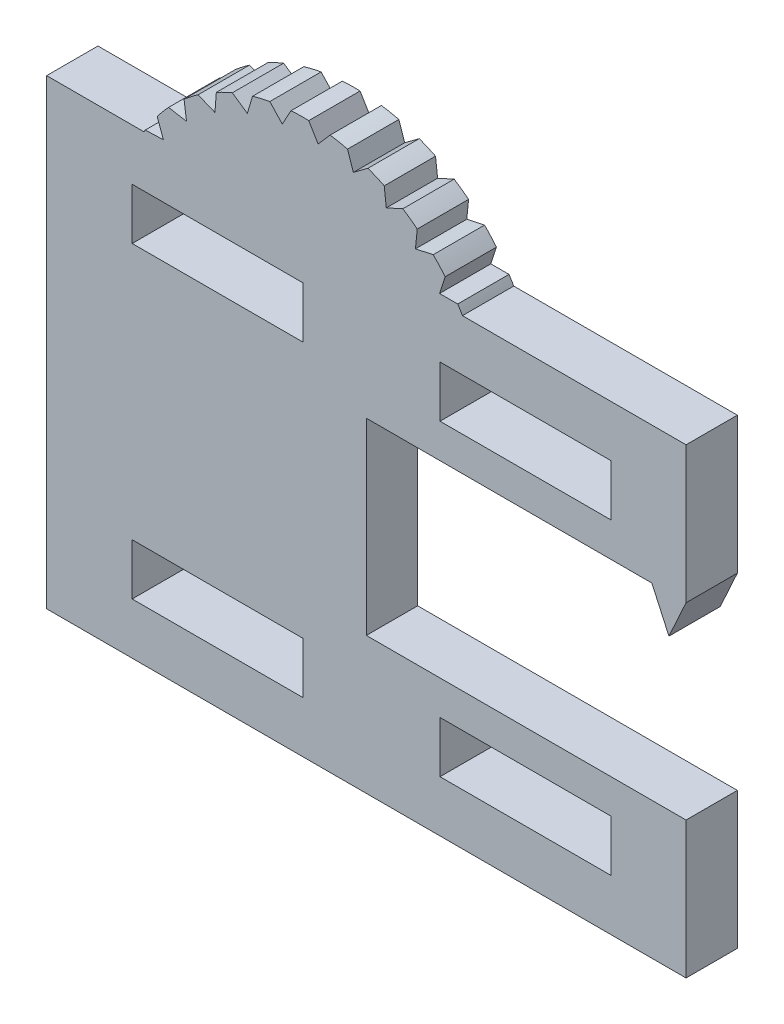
ISO-10303-21;
HEADER;
FILE_DESCRIPTION(('STEP AP214'),'2;1');
FILE_NAME('part.step','',(''),(''),'','','');
FILE_SCHEMA(('AUTOMOTIVE_DESIGN { 1 0 10303 214 1 1 1 1 }'));
ENDSEC;
DATA;
#1=APPLICATION_CONTEXT('core data for automotive mechanical design processes');
#2=APPLICATION_PROTOCOL_DEFINITION('international standard','automotive_design',2000,#1);
#3=PRODUCT_CONTEXT('',#1,'mechanical');
#4=PRODUCT('Part','Part','',(#3));
#5=PRODUCT_RELATED_PRODUCT_CATEGORY('part','',(#4));
#6=PRODUCT_DEFINITION_FORMATION('','',#4);
#7=PRODUCT_DEFINITION_CONTEXT('part definition',#1,'design');
#8=PRODUCT_DEFINITION('design','',#6,#7);
#9=PRODUCT_DEFINITION_SHAPE('','',#8);
#10=(LENGTH_UNIT() NAMED_UNIT(*) SI_UNIT(.MILLI.,.METRE.));
#11=(NAMED_UNIT(*) PLANE_ANGLE_UNIT() SI_UNIT($,.RADIAN.));
#12=(NAMED_UNIT(*) SI_UNIT($,.STERADIAN.) SOLID_ANGLE_UNIT());
#13=UNCERTAINTY_MEASURE_WITH_UNIT(LENGTH_MEASURE(1.E-05),#10,'distance_accuracy_value','');
#14=(GEOMETRIC_REPRESENTATION_CONTEXT(3) GLOBAL_UNCERTAINTY_ASSIGNED_CONTEXT((#13)) GLOBAL_UNIT_ASSIGNED_CONTEXT((#10,
#11,#12)) REPRESENTATION_CONTEXT('',''));
#15=CARTESIAN_POINT('',(0.,0.,0.));
#16=DIRECTION('',(0.,0.,1.));
#17=DIRECTION('',(1.,0.,0.));
#18=AXIS2_PLACEMENT_3D('',#15,#16,#17);
#19=CARTESIAN_POINT('',(-8.,21.,3.));
#20=DIRECTION('',(0.,-1.,0.));
#21=DIRECTION('',(0.,0.,-1.));
#22=AXIS2_PLACEMENT_3D('',#19,#20,#21);
#23=PLANE('',#22);
#24=DIRECTION('',(0.,0.,1.));
#25=VECTOR('',#24,1.);
#26=CARTESIAN_POINT('',(-39.6950952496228,21.,0.));
#27=LINE('',#26,#25);
#28=CARTESIAN_POINT('',(-39.6950952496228,21.,0.));
#29=VERTEX_POINT('',#28);
#30=CARTESIAN_POINT('',(-39.6950952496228,21.,3.));
#31=VERTEX_POINT('',#30);
#32=EDGE_CURVE('E623',#29,#31,#27,.T.);
#33=ORIENTED_EDGE('',*,*,#32,.F.);
#34=DIRECTION('',(-1.,0.,0.));
#35=VECTOR('',#34,1.);
#36=CARTESIAN_POINT('',(-8.,21.,0.));
#37=LINE('',#36,#35);
#38=CARTESIAN_POINT('',(-45.3846510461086,21.,0.));
#39=VERTEX_POINT('',#38);
#40=EDGE_CURVE('E659',#29,#39,#37,.T.);
#41=ORIENTED_EDGE('',*,*,#40,.T.);
#42=DIRECTION('',(0.,0.,-1.));
#43=VECTOR('',#42,1.);
#44=CARTESIAN_POINT('',(-45.3846510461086,21.,3.));
#45=LINE('',#44,#43);
#46=CARTESIAN_POINT('',(-45.3846510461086,21.,3.));
#47=VERTEX_POINT('',#46);
#48=EDGE_CURVE('E42',#47,#39,#45,.T.);
#49=ORIENTED_EDGE('',*,*,#48,.F.);
#50=DIRECTION('',(-1.,0.,0.));
#51=VECTOR('',#50,1.);
#52=CARTESIAN_POINT('',(-8.,21.,3.));
#53=LINE('',#52,#51);
#54=EDGE_CURVE('E640',#31,#47,#53,.T.);
#55=ORIENTED_EDGE('',*,*,#54,.F.);
#56=EDGE_LOOP('',(#33,#41,#49,#55));
#57=FACE_BOUND('',#56,.T.);
#58=ADVANCED_FACE('F33',(#57),#23,.F.);
#59=CARTESIAN_POINT('',(-8.,-6.,3.));
#60=DIRECTION('',(-1.,0.,0.));
#61=DIRECTION('',(0.,0.,1.));
#62=AXIS2_PLACEMENT_3D('',#59,#60,#61);
#63=PLANE('',#62);
#64=DIRECTION('',(0.,1.,0.));
#65=VECTOR('',#64,1.);
#66=CARTESIAN_POINT('',(-8.,-6.,3.));
#67=LINE('',#66,#65);
#68=CARTESIAN_POINT('',(-8.,13.,3.));
#69=VERTEX_POINT('',#68);
#70=CARTESIAN_POINT('',(-8.,21.,3.));
#71=VERTEX_POINT('',#70);
#72=EDGE_CURVE('E677',#69,#71,#67,.T.);
#73=ORIENTED_EDGE('',*,*,#72,.F.);
#74=DIRECTION('',(0.,0.,1.));
#75=VECTOR('',#74,1.);
#76=CARTESIAN_POINT('',(-8.,13.,0.));
#77=LINE('',#76,#75);
#78=CARTESIAN_POINT('',(-8.,13.,0.));
#79=VERTEX_POINT('',#78);
#80=EDGE_CURVE('E766',#79,#69,#77,.T.);
#81=ORIENTED_EDGE('',*,*,#80,.F.);
#82=DIRECTION('',(0.,1.,0.));
#83=VECTOR('',#82,1.);
#84=CARTESIAN_POINT('',(-8.,-6.,0.));
#85=LINE('',#84,#83);
#86=CARTESIAN_POINT('',(-8.,21.,0.));
#87=VERTEX_POINT('',#86);
#88=EDGE_CURVE('E660',#79,#87,#85,.T.);
#89=ORIENTED_EDGE('',*,*,#88,.T.);
#90=DIRECTION('',(0.,0.,-1.));
#91=VECTOR('',#90,1.);
#92=CARTESIAN_POINT('',(-8.,21.,3.));
#93=LINE('',#92,#91);
#94=EDGE_CURVE('E11',#71,#87,#93,.T.);
#95=ORIENTED_EDGE('',*,*,#94,.F.);
#96=EDGE_LOOP('',(#73,#81,#89,#95));
#97=FACE_BOUND('',#96,.T.);
#98=ADVANCED_FACE('F928',(#97),#63,.F.);
#99=CARTESIAN_POINT('',(0.,0.,3.));
#100=DIRECTION('',(0.,0.,1.));
#101=DIRECTION('',(1.,0.,0.));
#102=AXIS2_PLACEMENT_3D('',#99,#100,#101);
#103=PLANE('',#102);
#104=DIRECTION('',(-1.,0.,0.));
#105=VECTOR('',#104,1.);
#106=CARTESIAN_POINT('',(-11.6923255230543,13.,3.));
#107=LINE('',#106,#105);
#108=CARTESIAN_POINT('',(-9.99999999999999,13.,3.));
#109=VERTEX_POINT('',#108);
#110=CARTESIAN_POINT('',(-26.6923255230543,13.,3.));
#111=VERTEX_POINT('',#110);
#112=EDGE_CURVE('E904',#109,#111,#107,.T.);
#113=ORIENTED_EDGE('',*,*,#112,.F.);
#114=DIRECTION('',(0.415232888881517,-0.909715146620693,0.));
#115=VECTOR('',#114,1.);
#116=CARTESIAN_POINT('',(-9.,10.8091447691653,3.));
#117=LINE('',#116,#115);
#118=CARTESIAN_POINT('',(-9.,10.8091447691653,3.));
#119=VERTEX_POINT('',#118);
#120=EDGE_CURVE('E596',#109,#119,#117,.T.);
#121=ORIENTED_EDGE('',*,*,#120,.T.);
#122=DIRECTION('',(0.415232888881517,0.909715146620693,0.));
#123=VECTOR('',#122,1.);
#124=CARTESIAN_POINT('',(-8.,13.,3.));
#125=LINE('',#124,#123);
#126=EDGE_CURVE('E755',#119,#69,#125,.T.);
#127=ORIENTED_EDGE('',*,*,#126,.T.);
#128=ORIENTED_EDGE('',*,*,#72,.T.);
#129=CARTESIAN_POINT('',(-21.0742068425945,21.,3.));
#130=VERTEX_POINT('',#129);
#131=EDGE_CURVE('E643',#71,#130,#53,.T.);
#132=ORIENTED_EDGE('',*,*,#131,.T.);
#133=CARTESIAN_POINT('',(-30.3846510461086,15.6569896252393,3.));
#134=DIRECTION('',(0.,0.,1.));
#135=DIRECTION('',(1.,0.,0.));
#136=AXIS2_PLACEMENT_3D('',#133,#134,#135);
#137=CIRCLE('',#136,10.7346230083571);
#138=CARTESIAN_POINT('',(-21.3495530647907,21.4534657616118,3.));
#139=VERTEX_POINT('',#138);
#140=EDGE_CURVE('E50',#130,#139,#137,.T.);
#141=ORIENTED_EDGE('',*,*,#140,.T.);
#142=DIRECTION('',(-1.,0.,0.));
#143=VECTOR('',#142,1.);
#144=CARTESIAN_POINT('',(-21.3495530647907,21.4534657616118,3.));
#145=LINE('',#144,#143);
#146=CARTESIAN_POINT('',(-22.4135685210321,21.4534657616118,3.));
#147=VERTEX_POINT('',#146);
#148=EDGE_CURVE('E572',#139,#147,#145,.T.);
#149=ORIENTED_EDGE('',*,*,#148,.T.);
#150=DIRECTION('',(0.30821346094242,0.951317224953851,0.));
#151=VECTOR('',#150,1.);
#152=CARTESIAN_POINT('',(-22.4135685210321,21.4534657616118,3.));
#153=LINE('',#152,#151);
#154=CARTESIAN_POINT('',(-22.0856246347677,22.4656819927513,3.));
#155=VERTEX_POINT('',#154);
#156=EDGE_CURVE('E575',#147,#155,#153,.T.);
#157=ORIENTED_EDGE('',*,*,#156,.T.);
#158=CARTESIAN_POINT('',(-30.3846510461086,15.6569896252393,3.));
#159=DIRECTION('',(0.,0.,1.));
#160=DIRECTION('',(1.,0.,0.));
#161=AXIS2_PLACEMENT_3D('',#158,#159,#160);
#162=CIRCLE('',#161,10.7346230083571);
#163=CARTESIAN_POINT('',(-22.7814803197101,23.2348472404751,3.));
#164=VERTEX_POINT('',#163);
#165=EDGE_CURVE('E578',#155,#164,#162,.T.);
#166=ORIENTED_EDGE('',*,*,#165,.T.);
#167=DIRECTION('',(-0.977333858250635,-0.211703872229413,0.));
#168=VECTOR('',#167,1.);
#169=CARTESIAN_POINT('',(-22.7814803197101,23.2348472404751,3.));
#170=LINE('',#169,#168);
#171=CARTESIAN_POINT('',(-23.8213786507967,23.0095910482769,3.));
#172=VERTEX_POINT('',#171);
#173=EDGE_CURVE('E581',#164,#172,#170,.T.);
#174=ORIENTED_EDGE('',*,*,#173,.T.);
#175=DIRECTION('',(0.0998299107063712,0.995004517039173,0.));
#176=VECTOR('',#175,1.);
#177=CARTESIAN_POINT('',(-23.8213786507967,23.0095910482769,3.));
#178=LINE('',#177,#176);
#179=CARTESIAN_POINT('',(-23.71515808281,24.0682912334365,3.));
#180=VERTEX_POINT('',#179);
#181=EDGE_CURVE('E584',#172,#180,#178,.T.);
#182=ORIENTED_EDGE('',*,*,#181,.T.);
#183=CARTESIAN_POINT('',(-30.3846510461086,15.6569896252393,3.));
#184=DIRECTION('',(0.,0.,1.));
#185=DIRECTION('',(1.,0.,0.));
#186=AXIS2_PLACEMENT_3D('',#183,#184,#185);
#187=CIRCLE('',#186,10.7346230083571);
#188=CARTESIAN_POINT('',(-24.5580766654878,24.6727071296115,3.));
#189=VERTEX_POINT('',#188);
#190=EDGE_CURVE('E587',#180,#189,#187,.T.);
#191=ORIENTED_EDGE('',*,*,#190,.T.);
#192=DIRECTION('',(-0.910362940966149,-0.413810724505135,0.));
#193=VECTOR('',#192,1.);
#194=CARTESIAN_POINT('',(-24.5580766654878,24.6727071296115,3.));
#195=LINE('',#194,#193);
#196=CARTESIAN_POINT('',(-25.5267169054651,24.2324061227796,3.));
#197=VERTEX_POINT('',#196);
#198=EDGE_CURVE('E590',#189,#197,#195,.T.);
#199=ORIENTED_EDGE('',*,*,#198,.T.);
#200=DIRECTION('',(-0.113079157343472,0.99358598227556,0.));
#201=VECTOR('',#200,1.);
#202=CARTESIAN_POINT('',(-25.5267169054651,24.2324061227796,3.));
#203=LINE('',#202,#201);
#204=CARTESIAN_POINT('',(-25.6470348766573,25.2895969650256,3.));
#205=VERTEX_POINT('',#204);
#206=EDGE_CURVE('E432',#197,#205,#203,.T.);
#207=ORIENTED_EDGE('',*,*,#206,.T.);
#208=CARTESIAN_POINT('',(-30.3846510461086,15.6569896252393,3.));
#209=DIRECTION('',(0.,0.,1.));
#210=DIRECTION('',(1.,0.,0.));
#211=AXIS2_PLACEMENT_3D('',#208,#209,#210);
#212=CIRCLE('',#211,10.7346230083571);
#213=CARTESIAN_POINT('',(-26.5988049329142,25.7018639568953,3.));
#214=VERTEX_POINT('',#213);
#215=EDGE_CURVE('E429',#205,#214,#212,.T.);
#216=ORIENTED_EDGE('',*,*,#215,.T.);
#217=DIRECTION('',(-0.802123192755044,-0.597158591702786,0.));
#218=VECTOR('',#217,1.);
#219=CARTESIAN_POINT('',(-26.5988049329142,25.7018639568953,3.));
#220=LINE('',#219,#218);
#221=CARTESIAN_POINT('',(-27.4522764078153,25.0664779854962,3.));
#222=VERTEX_POINT('',#221);
#223=EDGE_CURVE('E514',#214,#222,#220,.T.);
#224=ORIENTED_EDGE('',*,*,#223,.T.);
#225=DIRECTION('',(-0.320862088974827,0.947125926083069,0.));
#226=VECTOR('',#225,1.);
#227=CARTESIAN_POINT('',(-27.4522764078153,25.0664779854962,3.));
#228=LINE('',#227,#226);
#229=CARTESIAN_POINT('',(-27.7936786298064,26.0742346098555,3.));
#230=VERTEX_POINT('',#229);
#231=EDGE_CURVE('E406',#222,#230,#228,.T.);
#232=ORIENTED_EDGE('',*,*,#231,.T.);
#233=CARTESIAN_POINT('',(-30.3846510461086,15.6569896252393,3.));
#234=DIRECTION('',(0.,0.,1.));
#235=DIRECTION('',(1.,0.,0.));
#236=AXIS2_PLACEMENT_3D('',#233,#234,#235);
#237=CIRCLE('',#236,10.7346230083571);
#238=CARTESIAN_POINT('',(-28.8111542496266,26.2756636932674,3.));
#239=VERTEX_POINT('',#238);
#240=EDGE_CURVE('E517',#230,#239,#237,.T.);
#241=ORIENTED_EDGE('',*,*,#240,.T.);
#242=DIRECTION('',(-0.657521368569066,-0.753435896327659,0.));
#243=VECTOR('',#242,1.);
#244=CARTESIAN_POINT('',(-28.8111542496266,26.2756636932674,3.));
#245=LINE('',#244,#243);
#246=CARTESIAN_POINT('',(-29.510767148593,25.4739962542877,3.));
#247=VERTEX_POINT('',#246);
#248=EDGE_CURVE('E520',#239,#247,#245,.T.);
#249=ORIENTED_EDGE('',*,*,#248,.T.);
#250=DIRECTION('',(-0.514099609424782,0.857730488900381,0.));
#251=VECTOR('',#250,1.);
#252=CARTESIAN_POINT('',(-29.510767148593,25.4739962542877,3.));
#253=LINE('',#252,#251);
#254=CARTESIAN_POINT('',(-30.0577770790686,26.3866347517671,3.));
#255=VERTEX_POINT('',#254);
#256=EDGE_CURVE('E523',#247,#255,#253,.T.);
#257=ORIENTED_EDGE('',*,*,#256,.T.);
#258=CARTESIAN_POINT('',(-30.3846510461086,15.6569896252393,3.));
#259=DIRECTION('',(0.,0.,1.));
#260=DIRECTION('',(1.,0.,0.));
#261=AXIS2_PLACEMENT_3D('',#258,#259,#260);
#262=CIRCLE('',#261,10.7346230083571);
#263=CARTESIAN_POINT('',(-31.0948337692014,26.368094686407,3.));
#264=VERTEX_POINT('',#263);
#265=EDGE_CURVE('E526',#255,#264,#262,.T.);
#266=ORIENTED_EDGE('',*,*,#265,.T.);
#267=DIRECTION('',(-0.483112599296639,-0.87555823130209,0.));
#268=VECTOR('',#267,1.);
#269=CARTESIAN_POINT('',(-31.0948337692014,26.368094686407,3.));
#270=LINE('',#269,#268);
#271=CARTESIAN_POINT('',(-31.6088730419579,25.4364871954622,3.));
#272=VERTEX_POINT('',#271);
#273=EDGE_CURVE('E529',#264,#272,#270,.T.);
#274=ORIENTED_EDGE('',*,*,#273,.T.);
#275=DIRECTION('',(-0.684031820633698,0.729452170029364,0.));
#276=VECTOR('',#275,1.);
#277=CARTESIAN_POINT('',(-31.6088730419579,25.4364871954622,3.));
#278=LINE('',#277,#276);
#279=CARTESIAN_POINT('',(-32.3366934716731,26.2126355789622,3.));
#280=VERTEX_POINT('',#279);
#281=EDGE_CURVE('E532',#272,#280,#278,.T.);
#282=ORIENTED_EDGE('',*,*,#281,.T.);
#283=CARTESIAN_POINT('',(-30.3846510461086,15.6569896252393,3.));
#284=DIRECTION('',(0.,0.,1.));
#285=DIRECTION('',(1.,0.,0.));
#286=AXIS2_PLACEMENT_3D('',#283,#284,#285);
#287=CIRCLE('',#286,10.7346230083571);
#288=CARTESIAN_POINT('',(-33.346319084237,25.974966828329,3.));
#289=VERTEX_POINT('',#288);
#290=EDGE_CURVE('E535',#280,#289,#287,.T.);
#291=ORIENTED_EDGE('',*,*,#290,.T.);
#292=DIRECTION('',(-0.286803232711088,-0.95798951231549,0.));
#293=VECTOR('',#292,1.);
#294=CARTESIAN_POINT('',(-33.346319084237,25.974966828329,3.));
#295=LINE('',#294,#293);
#296=CARTESIAN_POINT('',(-33.6514821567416,24.9556511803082,3.));
#297=VERTEX_POINT('',#296);
#298=EDGE_CURVE('E538',#289,#297,#295,.T.);
#299=ORIENTED_EDGE('',*,*,#298,.T.);
#300=DIRECTION('',(-0.822955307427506,0.568106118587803,0.));
#301=VECTOR('',#300,1.);
#302=CARTESIAN_POINT('',(-33.6514821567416,24.9556511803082,3.));
#303=LINE('',#302,#301);
#304=CARTESIAN_POINT('',(-34.5271193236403,25.5601248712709,3.));
#305=VERTEX_POINT('',#304);
#306=EDGE_CURVE('E541',#297,#305,#303,.T.);
#307=ORIENTED_EDGE('',*,*,#306,.T.);
#308=CARTESIAN_POINT('',(-30.3846510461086,15.6569896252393,3.));
#309=DIRECTION('',(0.,0.,1.));
#310=DIRECTION('',(1.,0.,0.));
#311=AXIS2_PLACEMENT_3D('',#308,#309,#310);
#312=CIRCLE('',#311,10.7346230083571);
#313=CARTESIAN_POINT('',(-35.4635452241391,25.1141015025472,3.));
#314=VERTEX_POINT('',#313);
#315=EDGE_CURVE('E544',#305,#314,#312,.T.);
#316=ORIENTED_EDGE('',*,*,#315,.T.);
#317=DIRECTION('',(-0.0774924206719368,-0.996992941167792,0.));
#318=VECTOR('',#317,1.);
#319=CARTESIAN_POINT('',(-35.4635452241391,25.1141015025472,3.));
#320=LINE('',#319,#318);
#321=CARTESIAN_POINT('',(-35.5459983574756,24.0532856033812,3.));
#322=VERTEX_POINT('',#321);
#323=EDGE_CURVE('E547',#314,#322,#320,.T.);
#324=ORIENTED_EDGE('',*,*,#323,.T.);
#325=DIRECTION('',(-0.924572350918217,0.381006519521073,0.));
#326=VECTOR('',#325,1.);
#327=CARTESIAN_POINT('',(-35.5459983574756,24.0532856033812,3.));
#328=LINE('',#327,#326);
#329=CARTESIAN_POINT('',(-36.529757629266,24.4586824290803,3.));
#330=VERTEX_POINT('',#329);
#331=EDGE_CURVE('E550',#322,#330,#328,.T.);
#332=ORIENTED_EDGE('',*,*,#331,.T.);
#333=CARTESIAN_POINT('',(-30.3846510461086,15.6569896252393,3.));
#334=DIRECTION('',(0.,0.,1.));
#335=DIRECTION('',(1.,0.,0.));
#336=AXIS2_PLACEMENT_3D('',#333,#334,#335);
#337=CIRCLE('',#336,10.7346230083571);
#338=CARTESIAN_POINT('',(-37.3505334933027,23.8245237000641,3.));
#339=VERTEX_POINT('',#338);
#340=EDGE_CURVE('E553',#330,#339,#337,.T.);
#341=ORIENTED_EDGE('',*,*,#340,.T.);
#342=DIRECTION('',(0.135331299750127,-0.990800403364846,0.));
#343=VECTOR('',#342,1.);
#344=CARTESIAN_POINT('',(-37.3505334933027,23.8245237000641,3.));
#345=LINE('',#344,#343);
#346=CARTESIAN_POINT('',(-37.2065388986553,22.7702967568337,3.));
#347=VERTEX_POINT('',#346);
#348=EDGE_CURVE('E556',#339,#347,#345,.T.);
#349=ORIENTED_EDGE('',*,*,#348,.T.);
#350=DIRECTION('',(-0.984276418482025,0.176635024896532,0.));
#351=VECTOR('',#350,1.);
#352=CARTESIAN_POINT('',(-37.2065388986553,22.7702967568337,3.));
#353=LINE('',#352,#351);
#354=CARTESIAN_POINT('',(-38.2538242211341,22.9582391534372,3.));
#355=VERTEX_POINT('',#354);
#356=EDGE_CURVE('E559',#347,#355,#353,.T.);
#357=ORIENTED_EDGE('',*,*,#356,.T.);
#358=CARTESIAN_POINT('',(-30.3846510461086,15.6569896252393,3.));
#359=DIRECTION('',(0.,0.,1.));
#360=DIRECTION('',(1.,0.,0.));
#361=AXIS2_PLACEMENT_3D('',#358,#359,#360);
#362=CIRCLE('',#361,10.7346230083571);
#363=CARTESIAN_POINT('',(-38.9217424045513,22.1646929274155,3.));
#364=VERTEX_POINT('',#363);
#365=EDGE_CURVE('E562',#355,#364,#362,.T.);
#366=ORIENTED_EDGE('',*,*,#365,.T.);
#367=DIRECTION('',(0.342020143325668,-0.939692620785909,0.));
#368=VECTOR('',#367,1.);
#369=CARTESIAN_POINT('',(-38.9217424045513,22.1646929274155,3.));
#370=LINE('',#369,#368);
#371=CARTESIAN_POINT('',(-38.5578276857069,21.1648454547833,3.));
#372=VERTEX_POINT('',#371);
#373=EDGE_CURVE('E565',#364,#372,#370,.T.);
#374=ORIENTED_EDGE('',*,*,#373,.T.);
#375=DIRECTION('',(-0.999360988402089,-0.0357437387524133,0.));
#376=VECTOR('',#375,1.);
#377=CARTESIAN_POINT('',(-38.5578276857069,21.1648454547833,3.));
#378=LINE('',#377,#376);
#379=CARTESIAN_POINT('',(-39.6211632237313,21.1268135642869,3.));
#380=VERTEX_POINT('',#379);
#381=EDGE_CURVE('E568',#372,#380,#378,.T.);
#382=ORIENTED_EDGE('',*,*,#381,.T.);
#383=CARTESIAN_POINT('',(-30.3846510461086,15.6569896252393,3.));
#384=DIRECTION('',(0.,0.,1.));
#385=DIRECTION('',(1.,0.,0.));
#386=AXIS2_PLACEMENT_3D('',#383,#384,#385);
#387=CIRCLE('',#386,10.7346230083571);
#388=EDGE_CURVE('E571',#380,#31,#387,.T.);
#389=ORIENTED_EDGE('',*,*,#388,.T.);
#390=ORIENTED_EDGE('',*,*,#54,.T.);
#391=DIRECTION('',(0.,-1.,0.));
#392=VECTOR('',#391,1.);
#393=CARTESIAN_POINT('',(-45.3846510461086,-6.,3.));
#394=LINE('',#393,#392);
#395=CARTESIAN_POINT('',(-45.3846510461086,-6.,3.));
#396=VERTEX_POINT('',#395);
#397=EDGE_CURVE('E650',#47,#396,#394,.T.);
#398=ORIENTED_EDGE('',*,*,#397,.T.);
#399=DIRECTION('',(1.,0.,0.));
#400=VECTOR('',#399,1.);
#401=CARTESIAN_POINT('',(-8.,-6.,3.));
#402=LINE('',#401,#400);
#403=CARTESIAN_POINT('',(-8.,-6.,3.));
#404=VERTEX_POINT('',#403);
#405=EDGE_CURVE('E653',#396,#404,#402,.T.);
#406=ORIENTED_EDGE('',*,*,#405,.T.);
#407=CARTESIAN_POINT('',(-8.,2.,3.));
#408=VERTEX_POINT('',#407);
#409=EDGE_CURVE('E644',#404,#408,#67,.T.);
#410=ORIENTED_EDGE('',*,*,#409,.T.);
#411=DIRECTION('',(1.,0.,0.));
#412=VECTOR('',#411,1.);
#413=CARTESIAN_POINT('',(-11.6923255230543,2.,3.));
#414=LINE('',#413,#412);
#415=CARTESIAN_POINT('',(-26.6923255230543,2.,3.));
#416=VERTEX_POINT('',#415);
#417=EDGE_CURVE('E702',#416,#408,#414,.T.);
#418=ORIENTED_EDGE('',*,*,#417,.F.);
#419=DIRECTION('',(0.,1.,0.));
#420=VECTOR('',#419,1.);
#421=CARTESIAN_POINT('',(-26.6923255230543,2.,3.));
#422=LINE('',#421,#420);
#423=EDGE_CURVE('E769',#416,#111,#422,.T.);
#424=ORIENTED_EDGE('',*,*,#423,.T.);
#425=EDGE_LOOP('',(#113,#121,#127,#128,#132,#141,#149,#157,#166,#174,#182,#191,#199,#207,#216,
#224,#232,#241,#249,#257,#266,#274,#282,#291,#299,#307,#316,#324,#332,#341,#349,#357,#366,#374,
#382,#389,#390,#398,#406,#410,#418,#424));
#426=FACE_BOUND('',#425,.T.);
#427=DIRECTION('',(0.,-1.,0.));
#428=VECTOR('',#427,1.);
#429=CARTESIAN_POINT('',(-22.3846510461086,18.,3.));
#430=LINE('',#429,#428);
#431=CARTESIAN_POINT('',(-22.3846510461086,18.,3.));
#432=VERTEX_POINT('',#431);
#433=CARTESIAN_POINT('',(-22.3846510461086,15.,3.));
#434=VERTEX_POINT('',#433);
#435=EDGE_CURVE('E814',#432,#434,#430,.T.);
#436=ORIENTED_EDGE('',*,*,#435,.F.);
#437=DIRECTION('',(-1.,0.,0.));
#438=VECTOR('',#437,1.);
#439=CARTESIAN_POINT('',(-22.3846510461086,18.,3.));
#440=LINE('',#439,#438);
#441=CARTESIAN_POINT('',(-12.3846510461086,18.,3.));
#442=VERTEX_POINT('',#441);
#443=EDGE_CURVE('E812',#442,#432,#440,.T.);
#444=ORIENTED_EDGE('',*,*,#443,.F.);
#445=DIRECTION('',(0.,1.,0.));
#446=VECTOR('',#445,1.);
#447=CARTESIAN_POINT('',(-12.3846510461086,18.,3.));
#448=LINE('',#447,#446);
#449=CARTESIAN_POINT('',(-12.3846510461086,15.,3.));
#450=VERTEX_POINT('',#449);
#451=EDGE_CURVE('E820',#450,#442,#448,.T.);
#452=ORIENTED_EDGE('',*,*,#451,.F.);
#453=DIRECTION('',(1.,0.,0.));
#454=VECTOR('',#453,1.);
#455=CARTESIAN_POINT('',(-22.3846510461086,15.,3.));
#456=LINE('',#455,#454);
#457=EDGE_CURVE('E817',#434,#450,#456,.T.);
#458=ORIENTED_EDGE('',*,*,#457,.F.);
#459=EDGE_LOOP('',(#436,#444,#452,#458));
#460=FACE_BOUND('',#459,.T.);
#461=DIRECTION('',(0.,1.,0.));
#462=VECTOR('',#461,1.);
#463=CARTESIAN_POINT('',(-12.3846510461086,-3.,3.));
#464=LINE('',#463,#462);
#465=CARTESIAN_POINT('',(-12.3846510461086,-3.,3.));
#466=VERTEX_POINT('',#465);
#467=CARTESIAN_POINT('',(-12.3846510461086,0.,3.));
#468=VERTEX_POINT('',#467);
#469=EDGE_CURVE('E876',#466,#468,#464,.T.);
#470=ORIENTED_EDGE('',*,*,#469,.F.);
#471=DIRECTION('',(1.,0.,0.));
#472=VECTOR('',#471,1.);
#473=CARTESIAN_POINT('',(-12.3846510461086,-3.,3.));
#474=LINE('',#473,#472);
#475=CARTESIAN_POINT('',(-22.3846510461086,-3.,3.));
#476=VERTEX_POINT('',#475);
#477=EDGE_CURVE('E874',#476,#466,#474,.T.);
#478=ORIENTED_EDGE('',*,*,#477,.F.);
#479=DIRECTION('',(0.,-1.,0.));
#480=VECTOR('',#479,1.);
#481=CARTESIAN_POINT('',(-22.3846510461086,-3.,3.));
#482=LINE('',#481,#480);
#483=CARTESIAN_POINT('',(-22.3846510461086,0.,3.));
#484=VERTEX_POINT('',#483);
#485=EDGE_CURVE('E882',#484,#476,#482,.T.);
#486=ORIENTED_EDGE('',*,*,#485,.F.);
#487=DIRECTION('',(-1.,0.,0.));
#488=VECTOR('',#487,1.);
#489=CARTESIAN_POINT('',(-12.3846510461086,0.,3.));
#490=LINE('',#489,#488);
#491=EDGE_CURVE('E879',#468,#484,#490,.T.);
#492=ORIENTED_EDGE('',*,*,#491,.F.);
#493=EDGE_LOOP('',(#470,#478,#486,#492));
#494=FACE_BOUND('',#493,.T.);
#495=DIRECTION('',(0.,1.,0.));
#496=VECTOR('',#495,1.);
#497=CARTESIAN_POINT('',(-30.3846510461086,-3.,3.));
#498=LINE('',#497,#496);
#499=CARTESIAN_POINT('',(-30.3846510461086,-3.,3.));
#500=VERTEX_POINT('',#499);
#501=CARTESIAN_POINT('',(-30.3846510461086,0.,3.));
#502=VERTEX_POINT('',#501);
#503=EDGE_CURVE('E845',#500,#502,#498,.T.);
#504=ORIENTED_EDGE('',*,*,#503,.F.);
#505=DIRECTION('',(1.,0.,0.));
#506=VECTOR('',#505,1.);
#507=CARTESIAN_POINT('',(-30.3846510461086,-3.,3.));
#508=LINE('',#507,#506);
#509=CARTESIAN_POINT('',(-40.3846510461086,-3.,3.));
#510=VERTEX_POINT('',#509);
#511=EDGE_CURVE('E843',#510,#500,#508,.T.);
#512=ORIENTED_EDGE('',*,*,#511,.F.);
#513=DIRECTION('',(0.,-1.,0.));
#514=VECTOR('',#513,1.);
#515=CARTESIAN_POINT('',(-40.3846510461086,-3.,3.));
#516=LINE('',#515,#514);
#517=CARTESIAN_POINT('',(-40.3846510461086,0.,3.));
#518=VERTEX_POINT('',#517);
#519=EDGE_CURVE('E851',#518,#510,#516,.T.);
#520=ORIENTED_EDGE('',*,*,#519,.F.);
#521=DIRECTION('',(-1.,0.,0.));
#522=VECTOR('',#521,1.);
#523=CARTESIAN_POINT('',(-30.3846510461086,0.,3.));
#524=LINE('',#523,#522);
#525=EDGE_CURVE('E848',#502,#518,#524,.T.);
#526=ORIENTED_EDGE('',*,*,#525,.F.);
#527=EDGE_LOOP('',(#504,#512,#520,#526));
#528=FACE_BOUND('',#527,.T.);
#529=DIRECTION('',(1.,0.,0.));
#530=VECTOR('',#529,1.);
#531=CARTESIAN_POINT('',(-40.3846510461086,15.,3.));
#532=LINE('',#531,#530);
#533=CARTESIAN_POINT('',(-40.3846510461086,15.,3.));
#534=VERTEX_POINT('',#533);
#535=CARTESIAN_POINT('',(-30.3846510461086,15.,3.));
#536=VERTEX_POINT('',#535);
#537=EDGE_CURVE('E783',#534,#536,#532,.T.);
#538=ORIENTED_EDGE('',*,*,#537,.F.);
#539=DIRECTION('',(0.,-1.,0.));
#540=VECTOR('',#539,1.);
#541=CARTESIAN_POINT('',(-40.3846510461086,18.,3.));
#542=LINE('',#541,#540);
#543=CARTESIAN_POINT('',(-40.3846510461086,18.,3.));
#544=VERTEX_POINT('',#543);
#545=EDGE_CURVE('E781',#544,#534,#542,.T.);
#546=ORIENTED_EDGE('',*,*,#545,.F.);
#547=DIRECTION('',(-1.,0.,0.));
#548=VECTOR('',#547,1.);
#549=CARTESIAN_POINT('',(-40.3846510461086,18.,3.));
#550=LINE('',#549,#548);
#551=CARTESIAN_POINT('',(-30.3846510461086,18.,3.));
#552=VERTEX_POINT('',#551);
#553=EDGE_CURVE('E789',#552,#544,#550,.T.);
#554=ORIENTED_EDGE('',*,*,#553,.F.);
#555=DIRECTION('',(0.,1.,0.));
#556=VECTOR('',#555,1.);
#557=CARTESIAN_POINT('',(-30.3846510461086,18.,3.));
#558=LINE('',#557,#556);
#559=EDGE_CURVE('E786',#536,#552,#558,.T.);
#560=ORIENTED_EDGE('',*,*,#559,.F.);
#561=EDGE_LOOP('',(#538,#546,#554,#560));
#562=FACE_BOUND('',#561,.T.);
#563=ADVANCED_FACE('F699',(#426,#460,#494,#528,#562),#103,.T.);
#564=CARTESIAN_POINT('',(0.,0.,0.));
#565=DIRECTION('',(0.,0.,1.));
#566=DIRECTION('',(1.,0.,0.));
#567=AXIS2_PLACEMENT_3D('',#564,#565,#566);
#568=PLANE('',#567);
#569=DIRECTION('',(-1.,0.,0.));
#570=VECTOR('',#569,1.);
#571=CARTESIAN_POINT('',(-22.3846510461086,18.,0.));
#572=LINE('',#571,#570);
#573=CARTESIAN_POINT('',(-12.3846510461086,18.,0.));
#574=VERTEX_POINT('',#573);
#575=CARTESIAN_POINT('',(-22.3846510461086,18.,0.));
#576=VERTEX_POINT('',#575);
#577=EDGE_CURVE('E811',#574,#576,#572,.T.);
#578=ORIENTED_EDGE('',*,*,#577,.T.);
#579=DIRECTION('',(0.,-1.,0.));
#580=VECTOR('',#579,1.);
#581=CARTESIAN_POINT('',(-22.3846510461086,18.,0.));
#582=LINE('',#581,#580);
#583=CARTESIAN_POINT('',(-22.3846510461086,15.,0.));
#584=VERTEX_POINT('',#583);
#585=EDGE_CURVE('E825',#576,#584,#582,.T.);
#586=ORIENTED_EDGE('',*,*,#585,.T.);
#587=DIRECTION('',(1.,0.,0.));
#588=VECTOR('',#587,1.);
#589=CARTESIAN_POINT('',(-22.3846510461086,15.,0.));
#590=LINE('',#589,#588);
#591=CARTESIAN_POINT('',(-12.3846510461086,15.,0.));
#592=VERTEX_POINT('',#591);
#593=EDGE_CURVE('E828',#584,#592,#590,.T.);
#594=ORIENTED_EDGE('',*,*,#593,.T.);
#595=DIRECTION('',(0.,1.,0.));
#596=VECTOR('',#595,1.);
#597=CARTESIAN_POINT('',(-12.3846510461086,18.,0.));
#598=LINE('',#597,#596);
#599=EDGE_CURVE('E815',#592,#574,#598,.T.);
#600=ORIENTED_EDGE('',*,*,#599,.T.);
#601=EDGE_LOOP('',(#578,#586,#594,#600));
#602=FACE_BOUND('',#601,.T.);
#603=DIRECTION('',(1.,0.,0.));
#604=VECTOR('',#603,1.);
#605=CARTESIAN_POINT('',(-12.3846510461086,-3.,0.));
#606=LINE('',#605,#604);
#607=CARTESIAN_POINT('',(-22.3846510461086,-3.,0.));
#608=VERTEX_POINT('',#607);
#609=CARTESIAN_POINT('',(-12.3846510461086,-3.,0.));
#610=VERTEX_POINT('',#609);
#611=EDGE_CURVE('E873',#608,#610,#606,.T.);
#612=ORIENTED_EDGE('',*,*,#611,.T.);
#613=DIRECTION('',(0.,1.,0.));
#614=VECTOR('',#613,1.);
#615=CARTESIAN_POINT('',(-12.3846510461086,-3.,0.));
#616=LINE('',#615,#614);
#617=CARTESIAN_POINT('',(-12.3846510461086,0.,0.));
#618=VERTEX_POINT('',#617);
#619=EDGE_CURVE('E887',#610,#618,#616,.T.);
#620=ORIENTED_EDGE('',*,*,#619,.T.);
#621=DIRECTION('',(-1.,0.,0.));
#622=VECTOR('',#621,1.);
#623=CARTESIAN_POINT('',(-12.3846510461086,0.,0.));
#624=LINE('',#623,#622);
#625=CARTESIAN_POINT('',(-22.3846510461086,0.,0.));
#626=VERTEX_POINT('',#625);
#627=EDGE_CURVE('E890',#618,#626,#624,.T.);
#628=ORIENTED_EDGE('',*,*,#627,.T.);
#629=DIRECTION('',(0.,-1.,0.));
#630=VECTOR('',#629,1.);
#631=CARTESIAN_POINT('',(-22.3846510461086,-3.,0.));
#632=LINE('',#631,#630);
#633=EDGE_CURVE('E877',#626,#608,#632,.T.);
#634=ORIENTED_EDGE('',*,*,#633,.T.);
#635=EDGE_LOOP('',(#612,#620,#628,#634));
#636=FACE_BOUND('',#635,.T.);
#637=ORIENTED_EDGE('',*,*,#88,.F.);
#638=DIRECTION('',(0.415232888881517,0.909715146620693,0.));
#639=VECTOR('',#638,1.);
#640=CARTESIAN_POINT('',(-8.,13.,0.));
#641=LINE('',#640,#639);
#642=CARTESIAN_POINT('',(-9.,10.8091447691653,0.));
#643=VERTEX_POINT('',#642);
#644=EDGE_CURVE('E754',#643,#79,#641,.T.);
#645=ORIENTED_EDGE('',*,*,#644,.F.);
#646=DIRECTION('',(0.415232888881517,-0.909715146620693,0.));
#647=VECTOR('',#646,1.);
#648=CARTESIAN_POINT('',(-9.,10.8091447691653,0.));
#649=LINE('',#648,#647);
#650=CARTESIAN_POINT('',(-9.99999999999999,13.,0.));
#651=VERTEX_POINT('',#650);
#652=EDGE_CURVE('E751',#651,#643,#649,.T.);
#653=ORIENTED_EDGE('',*,*,#652,.F.);
#654=DIRECTION('',(-1.,0.,0.));
#655=VECTOR('',#654,1.);
#656=CARTESIAN_POINT('',(-11.6923255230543,13.,0.));
#657=LINE('',#656,#655);
#658=CARTESIAN_POINT('',(-26.6923255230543,13.,0.));
#659=VERTEX_POINT('',#658);
#660=EDGE_CURVE('E58',#651,#659,#657,.T.);
#661=ORIENTED_EDGE('',*,*,#660,.T.);
#662=DIRECTION('',(0.,1.,0.));
#663=VECTOR('',#662,1.);
#664=CARTESIAN_POINT('',(-26.6923255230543,2.,0.));
#665=LINE('',#664,#663);
#666=CARTESIAN_POINT('',(-26.6923255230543,2.,0.));
#667=VERTEX_POINT('',#666);
#668=EDGE_CURVE('E771',#667,#659,#665,.T.);
#669=ORIENTED_EDGE('',*,*,#668,.F.);
#670=DIRECTION('',(1.,0.,0.));
#671=VECTOR('',#670,1.);
#672=CARTESIAN_POINT('',(-11.6923255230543,2.,0.));
#673=LINE('',#672,#671);
#674=CARTESIAN_POINT('',(-8.,2.,0.));
#675=VERTEX_POINT('',#674);
#676=EDGE_CURVE('E692',#667,#675,#673,.T.);
#677=ORIENTED_EDGE('',*,*,#676,.T.);
#678=CARTESIAN_POINT('',(-8.,-6.,0.));
#679=VERTEX_POINT('',#678);
#680=EDGE_CURVE('E656',#679,#675,#85,.T.);
#681=ORIENTED_EDGE('',*,*,#680,.F.);
#682=DIRECTION('',(1.,0.,0.));
#683=VECTOR('',#682,1.);
#684=CARTESIAN_POINT('',(-8.,-6.,0.));
#685=LINE('',#684,#683);
#686=CARTESIAN_POINT('',(-45.3846510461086,-6.,0.));
#687=VERTEX_POINT('',#686);
#688=EDGE_CURVE('E676',#687,#679,#685,.T.);
#689=ORIENTED_EDGE('',*,*,#688,.F.);
#690=DIRECTION('',(0.,-1.,0.));
#691=VECTOR('',#690,1.);
#692=CARTESIAN_POINT('',(-45.3846510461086,-6.,0.));
#693=LINE('',#692,#691);
#694=EDGE_CURVE('E663',#39,#687,#693,.T.);
#695=ORIENTED_EDGE('',*,*,#694,.F.);
#696=ORIENTED_EDGE('',*,*,#40,.F.);
#697=CARTESIAN_POINT('',(-30.3846510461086,15.6569896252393,0.));
#698=DIRECTION('',(0.,0.,1.));
#699=DIRECTION('',(1.,0.,0.));
#700=AXIS2_PLACEMENT_3D('',#697,#698,#699);
#701=CIRCLE('',#700,10.7346230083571);
#702=CARTESIAN_POINT('',(-39.6211632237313,21.1268135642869,0.));
#703=VERTEX_POINT('',#702);
#704=EDGE_CURVE('E487',#703,#29,#701,.T.);
#705=ORIENTED_EDGE('',*,*,#704,.F.);
#706=DIRECTION('',(-0.999360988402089,-0.0357437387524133,0.));
#707=VECTOR('',#706,1.);
#708=CARTESIAN_POINT('',(-38.5578276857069,21.1648454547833,0.));
#709=LINE('',#708,#707);
#710=CARTESIAN_POINT('',(-38.5578276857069,21.1648454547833,0.));
#711=VERTEX_POINT('',#710);
#712=EDGE_CURVE('E484',#711,#703,#709,.T.);
#713=ORIENTED_EDGE('',*,*,#712,.F.);
#714=DIRECTION('',(0.342020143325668,-0.939692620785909,0.));
#715=VECTOR('',#714,1.);
#716=CARTESIAN_POINT('',(-38.9217424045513,22.1646929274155,0.));
#717=LINE('',#716,#715);
#718=CARTESIAN_POINT('',(-38.9217424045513,22.1646929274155,0.));
#719=VERTEX_POINT('',#718);
#720=EDGE_CURVE('E481',#719,#711,#717,.T.);
#721=ORIENTED_EDGE('',*,*,#720,.F.);
#722=CARTESIAN_POINT('',(-30.3846510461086,15.6569896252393,0.));
#723=DIRECTION('',(0.,0.,1.));
#724=DIRECTION('',(1.,0.,0.));
#725=AXIS2_PLACEMENT_3D('',#722,#723,#724);
#726=CIRCLE('',#725,10.7346230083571);
#727=CARTESIAN_POINT('',(-38.2538242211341,22.9582391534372,0.));
#728=VERTEX_POINT('',#727);
#729=EDGE_CURVE('E478',#728,#719,#726,.T.);
#730=ORIENTED_EDGE('',*,*,#729,.F.);
#731=DIRECTION('',(-0.984276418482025,0.176635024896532,0.));
#732=VECTOR('',#731,1.);
#733=CARTESIAN_POINT('',(-37.2065388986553,22.7702967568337,0.));
#734=LINE('',#733,#732);
#735=CARTESIAN_POINT('',(-37.2065388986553,22.7702967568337,0.));
#736=VERTEX_POINT('',#735);
#737=EDGE_CURVE('E475',#736,#728,#734,.T.);
#738=ORIENTED_EDGE('',*,*,#737,.F.);
#739=DIRECTION('',(0.135331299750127,-0.990800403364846,0.));
#740=VECTOR('',#739,1.);
#741=CARTESIAN_POINT('',(-37.3505334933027,23.8245237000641,0.));
#742=LINE('',#741,#740);
#743=CARTESIAN_POINT('',(-37.3505334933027,23.8245237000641,0.));
#744=VERTEX_POINT('',#743);
#745=EDGE_CURVE('E472',#744,#736,#742,.T.);
#746=ORIENTED_EDGE('',*,*,#745,.F.);
#747=CARTESIAN_POINT('',(-30.3846510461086,15.6569896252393,0.));
#748=DIRECTION('',(0.,0.,1.));
#749=DIRECTION('',(1.,0.,0.));
#750=AXIS2_PLACEMENT_3D('',#747,#748,#749);
#751=CIRCLE('',#750,10.7346230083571);
#752=CARTESIAN_POINT('',(-36.529757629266,24.4586824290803,0.));
#753=VERTEX_POINT('',#752);
#754=EDGE_CURVE('E469',#753,#744,#751,.T.);
#755=ORIENTED_EDGE('',*,*,#754,.F.);
#756=DIRECTION('',(-0.924572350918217,0.381006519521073,0.));
#757=VECTOR('',#756,1.);
#758=CARTESIAN_POINT('',(-35.5459983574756,24.0532856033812,0.));
#759=LINE('',#758,#757);
#760=CARTESIAN_POINT('',(-35.5459983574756,24.0532856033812,0.));
#761=VERTEX_POINT('',#760);
#762=EDGE_CURVE('E466',#761,#753,#759,.T.);
#763=ORIENTED_EDGE('',*,*,#762,.F.);
#764=DIRECTION('',(-0.0774924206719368,-0.996992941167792,0.));
#765=VECTOR('',#764,1.);
#766=CARTESIAN_POINT('',(-35.4635452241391,25.1141015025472,0.));
#767=LINE('',#766,#765);
#768=CARTESIAN_POINT('',(-35.4635452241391,25.1141015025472,0.));
#769=VERTEX_POINT('',#768);
#770=EDGE_CURVE('E463',#769,#761,#767,.T.);
#771=ORIENTED_EDGE('',*,*,#770,.F.);
#772=CARTESIAN_POINT('',(-30.3846510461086,15.6569896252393,0.));
#773=DIRECTION('',(0.,0.,1.));
#774=DIRECTION('',(1.,0.,0.));
#775=AXIS2_PLACEMENT_3D('',#772,#773,#774);
#776=CIRCLE('',#775,10.7346230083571);
#777=CARTESIAN_POINT('',(-34.5271193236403,25.5601248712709,0.));
#778=VERTEX_POINT('',#777);
#779=EDGE_CURVE('E460',#778,#769,#776,.T.);
#780=ORIENTED_EDGE('',*,*,#779,.F.);
#781=DIRECTION('',(-0.822955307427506,0.568106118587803,0.));
#782=VECTOR('',#781,1.);
#783=CARTESIAN_POINT('',(-33.6514821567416,24.9556511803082,0.));
#784=LINE('',#783,#782);
#785=CARTESIAN_POINT('',(-33.6514821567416,24.9556511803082,0.));
#786=VERTEX_POINT('',#785);
#787=EDGE_CURVE('E457',#786,#778,#784,.T.);
#788=ORIENTED_EDGE('',*,*,#787,.F.);
#789=DIRECTION('',(-0.286803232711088,-0.95798951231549,0.));
#790=VECTOR('',#789,1.);
#791=CARTESIAN_POINT('',(-33.346319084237,25.974966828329,0.));
#792=LINE('',#791,#790);
#793=CARTESIAN_POINT('',(-33.346319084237,25.974966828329,0.));
#794=VERTEX_POINT('',#793);
#795=EDGE_CURVE('E454',#794,#786,#792,.T.);
#796=ORIENTED_EDGE('',*,*,#795,.F.);
#797=CARTESIAN_POINT('',(-30.3846510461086,15.6569896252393,0.));
#798=DIRECTION('',(0.,0.,1.));
#799=DIRECTION('',(1.,0.,0.));
#800=AXIS2_PLACEMENT_3D('',#797,#798,#799);
#801=CIRCLE('',#800,10.7346230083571);
#802=CARTESIAN_POINT('',(-32.3366934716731,26.2126355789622,0.));
#803=VERTEX_POINT('',#802);
#804=EDGE_CURVE('E451',#803,#794,#801,.T.);
#805=ORIENTED_EDGE('',*,*,#804,.F.);
#806=DIRECTION('',(-0.684031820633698,0.729452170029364,0.));
#807=VECTOR('',#806,1.);
#808=CARTESIAN_POINT('',(-31.6088730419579,25.4364871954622,0.));
#809=LINE('',#808,#807);
#810=CARTESIAN_POINT('',(-31.6088730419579,25.4364871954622,0.));
#811=VERTEX_POINT('',#810);
#812=EDGE_CURVE('E448',#811,#803,#809,.T.);
#813=ORIENTED_EDGE('',*,*,#812,.F.);
#814=DIRECTION('',(-0.483112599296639,-0.87555823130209,0.));
#815=VECTOR('',#814,1.);
#816=CARTESIAN_POINT('',(-31.0948337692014,26.368094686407,0.));
#817=LINE('',#816,#815);
#818=CARTESIAN_POINT('',(-31.0948337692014,26.368094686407,0.));
#819=VERTEX_POINT('',#818);
#820=EDGE_CURVE('E445',#819,#811,#817,.T.);
#821=ORIENTED_EDGE('',*,*,#820,.F.);
#822=CARTESIAN_POINT('',(-30.3846510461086,15.6569896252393,0.));
#823=DIRECTION('',(0.,0.,1.));
#824=DIRECTION('',(1.,0.,0.));
#825=AXIS2_PLACEMENT_3D('',#822,#823,#824);
#826=CIRCLE('',#825,10.7346230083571);
#827=CARTESIAN_POINT('',(-30.0577770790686,26.3866347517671,0.));
#828=VERTEX_POINT('',#827);
#829=EDGE_CURVE('E442',#828,#819,#826,.T.);
#830=ORIENTED_EDGE('',*,*,#829,.F.);
#831=DIRECTION('',(-0.514099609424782,0.857730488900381,0.));
#832=VECTOR('',#831,1.);
#833=CARTESIAN_POINT('',(-29.510767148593,25.4739962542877,0.));
#834=LINE('',#833,#832);
#835=CARTESIAN_POINT('',(-29.510767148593,25.4739962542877,0.));
#836=VERTEX_POINT('',#835);
#837=EDGE_CURVE('E439',#836,#828,#834,.T.);
#838=ORIENTED_EDGE('',*,*,#837,.F.);
#839=DIRECTION('',(-0.657521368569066,-0.753435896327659,0.));
#840=VECTOR('',#839,1.);
#841=CARTESIAN_POINT('',(-28.8111542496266,26.2756636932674,0.));
#842=LINE('',#841,#840);
#843=CARTESIAN_POINT('',(-28.8111542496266,26.2756636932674,0.));
#844=VERTEX_POINT('',#843);
#845=EDGE_CURVE('E436',#844,#836,#842,.T.);
#846=ORIENTED_EDGE('',*,*,#845,.F.);
#847=CARTESIAN_POINT('',(-30.3846510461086,15.6569896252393,0.));
#848=DIRECTION('',(0.,0.,1.));
#849=DIRECTION('',(1.,0.,0.));
#850=AXIS2_PLACEMENT_3D('',#847,#848,#849);
#851=CIRCLE('',#850,10.7346230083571);
#852=CARTESIAN_POINT('',(-27.7936786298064,26.0742346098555,0.));
#853=VERTEX_POINT('',#852);
#854=EDGE_CURVE('E425',#853,#844,#851,.T.);
#855=ORIENTED_EDGE('',*,*,#854,.F.);
#856=DIRECTION('',(-0.320862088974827,0.947125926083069,0.));
#857=VECTOR('',#856,1.);
#858=CARTESIAN_POINT('',(-27.4522764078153,25.0664779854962,0.));
#859=LINE('',#858,#857);
#860=CARTESIAN_POINT('',(-27.4522764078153,25.0664779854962,0.));
#861=VERTEX_POINT('',#860);
#862=EDGE_CURVE('E404',#861,#853,#859,.T.);
#863=ORIENTED_EDGE('',*,*,#862,.F.);
#864=DIRECTION('',(-0.802123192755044,-0.597158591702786,0.));
#865=VECTOR('',#864,1.);
#866=CARTESIAN_POINT('',(-26.5988049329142,25.7018639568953,0.));
#867=LINE('',#866,#865);
#868=CARTESIAN_POINT('',(-26.5988049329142,25.7018639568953,0.));
#869=VERTEX_POINT('',#868);
#870=EDGE_CURVE('E421',#869,#861,#867,.T.);
#871=ORIENTED_EDGE('',*,*,#870,.F.);
#872=CARTESIAN_POINT('',(-30.3846510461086,15.6569896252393,0.));
#873=DIRECTION('',(0.,0.,1.));
#874=DIRECTION('',(1.,0.,0.));
#875=AXIS2_PLACEMENT_3D('',#872,#873,#874);
#876=CIRCLE('',#875,10.7346230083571);
#877=CARTESIAN_POINT('',(-25.6470348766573,25.2895969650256,0.));
#878=VERTEX_POINT('',#877);
#879=EDGE_CURVE('E412',#878,#869,#876,.T.);
#880=ORIENTED_EDGE('',*,*,#879,.F.);
#881=DIRECTION('',(-0.113079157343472,0.99358598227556,0.));
#882=VECTOR('',#881,1.);
#883=CARTESIAN_POINT('',(-25.5267169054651,24.2324061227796,0.));
#884=LINE('',#883,#882);
#885=CARTESIAN_POINT('',(-25.5267169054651,24.2324061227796,0.));
#886=VERTEX_POINT('',#885);
#887=EDGE_CURVE('E510',#886,#878,#884,.T.);
#888=ORIENTED_EDGE('',*,*,#887,.F.);
#889=DIRECTION('',(-0.910362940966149,-0.413810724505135,0.));
#890=VECTOR('',#889,1.);
#891=CARTESIAN_POINT('',(-24.5580766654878,24.6727071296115,0.));
#892=LINE('',#891,#890);
#893=CARTESIAN_POINT('',(-24.5580766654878,24.6727071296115,0.));
#894=VERTEX_POINT('',#893);
#895=EDGE_CURVE('E507',#894,#886,#892,.T.);
#896=ORIENTED_EDGE('',*,*,#895,.F.);
#897=CARTESIAN_POINT('',(-30.3846510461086,15.6569896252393,0.));
#898=DIRECTION('',(0.,0.,1.));
#899=DIRECTION('',(1.,0.,0.));
#900=AXIS2_PLACEMENT_3D('',#897,#898,#899);
#901=CIRCLE('',#900,10.7346230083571);
#902=CARTESIAN_POINT('',(-23.71515808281,24.0682912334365,0.));
#903=VERTEX_POINT('',#902);
#904=EDGE_CURVE('E504',#903,#894,#901,.T.);
#905=ORIENTED_EDGE('',*,*,#904,.F.);
#906=DIRECTION('',(0.0998299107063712,0.995004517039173,0.));
#907=VECTOR('',#906,1.);
#908=CARTESIAN_POINT('',(-23.8213786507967,23.0095910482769,0.));
#909=LINE('',#908,#907);
#910=CARTESIAN_POINT('',(-23.8213786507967,23.0095910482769,0.));
#911=VERTEX_POINT('',#910);
#912=EDGE_CURVE('E501',#911,#903,#909,.T.);
#913=ORIENTED_EDGE('',*,*,#912,.F.);
#914=DIRECTION('',(-0.977333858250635,-0.211703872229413,0.));
#915=VECTOR('',#914,1.);
#916=CARTESIAN_POINT('',(-22.7814803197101,23.2348472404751,0.));
#917=LINE('',#916,#915);
#918=CARTESIAN_POINT('',(-22.7814803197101,23.2348472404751,0.));
#919=VERTEX_POINT('',#918);
#920=EDGE_CURVE('E498',#919,#911,#917,.T.);
#921=ORIENTED_EDGE('',*,*,#920,.F.);
#922=CARTESIAN_POINT('',(-30.3846510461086,15.6569896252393,0.));
#923=DIRECTION('',(0.,0.,1.));
#924=DIRECTION('',(1.,0.,0.));
#925=AXIS2_PLACEMENT_3D('',#922,#923,#924);
#926=CIRCLE('',#925,10.7346230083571);
#927=CARTESIAN_POINT('',(-22.0856246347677,22.4656819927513,0.));
#928=VERTEX_POINT('',#927);
#929=EDGE_CURVE('E495',#928,#919,#926,.T.);
#930=ORIENTED_EDGE('',*,*,#929,.F.);
#931=DIRECTION('',(0.30821346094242,0.951317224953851,0.));
#932=VECTOR('',#931,1.);
#933=CARTESIAN_POINT('',(-22.4135685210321,21.4534657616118,0.));
#934=LINE('',#933,#932);
#935=CARTESIAN_POINT('',(-22.4135685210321,21.4534657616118,0.));
#936=VERTEX_POINT('',#935);
#937=EDGE_CURVE('E491',#936,#928,#934,.T.);
#938=ORIENTED_EDGE('',*,*,#937,.F.);
#939=DIRECTION('',(-1.,0.,0.));
#940=VECTOR('',#939,1.);
#941=CARTESIAN_POINT('',(-21.3495530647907,21.4534657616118,0.));
#942=LINE('',#941,#940);
#943=CARTESIAN_POINT('',(-21.3495530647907,21.4534657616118,0.));
#944=VERTEX_POINT('',#943);
#945=EDGE_CURVE('E488',#944,#936,#942,.T.);
#946=ORIENTED_EDGE('',*,*,#945,.F.);
#947=CARTESIAN_POINT('',(-30.3846510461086,15.6569896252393,0.));
#948=DIRECTION('',(0.,0.,1.));
#949=DIRECTION('',(1.,0.,0.));
#950=AXIS2_PLACEMENT_3D('',#947,#948,#949);
#951=CIRCLE('',#950,10.7346230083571);
#952=CARTESIAN_POINT('',(-21.0742068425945,21.,0.));
#953=VERTEX_POINT('',#952);
#954=EDGE_CURVE('E492',#953,#944,#951,.T.);
#955=ORIENTED_EDGE('',*,*,#954,.F.);
#956=EDGE_CURVE('E667',#87,#953,#37,.T.);
#957=ORIENTED_EDGE('',*,*,#956,.F.);
#958=EDGE_LOOP('',(#637,#645,#653,#661,#669,#677,#681,#689,#695,#696,#705,#713,#721,#730,#738,
#746,#755,#763,#771,#780,#788,#796,#805,#813,#821,#830,#838,#846,#855,#863,#871,#880,#888,#896,
#905,#913,#921,#930,#938,#946,#955,#957));
#959=FACE_BOUND('',#958,.T.);
#960=DIRECTION('',(1.,0.,0.));
#961=VECTOR('',#960,1.);
#962=CARTESIAN_POINT('',(-30.3846510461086,-3.,0.));
#963=LINE('',#962,#961);
#964=CARTESIAN_POINT('',(-40.3846510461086,-3.,0.));
#965=VERTEX_POINT('',#964);
#966=CARTESIAN_POINT('',(-30.3846510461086,-3.,0.));
#967=VERTEX_POINT('',#966);
#968=EDGE_CURVE('E842',#965,#967,#963,.T.);
#969=ORIENTED_EDGE('',*,*,#968,.T.);
#970=DIRECTION('',(0.,1.,0.));
#971=VECTOR('',#970,1.);
#972=CARTESIAN_POINT('',(-30.3846510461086,-3.,0.));
#973=LINE('',#972,#971);
#974=CARTESIAN_POINT('',(-30.3846510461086,0.,0.));
#975=VERTEX_POINT('',#974);
#976=EDGE_CURVE('E856',#967,#975,#973,.T.);
#977=ORIENTED_EDGE('',*,*,#976,.T.);
#978=DIRECTION('',(-1.,0.,0.));
#979=VECTOR('',#978,1.);
#980=CARTESIAN_POINT('',(-30.3846510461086,0.,0.));
#981=LINE('',#980,#979);
#982=CARTESIAN_POINT('',(-40.3846510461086,0.,0.));
#983=VERTEX_POINT('',#982);
#984=EDGE_CURVE('E859',#975,#983,#981,.T.);
#985=ORIENTED_EDGE('',*,*,#984,.T.);
#986=DIRECTION('',(0.,-1.,0.));
#987=VECTOR('',#986,1.);
#988=CARTESIAN_POINT('',(-40.3846510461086,-3.,0.));
#989=LINE('',#988,#987);
#990=EDGE_CURVE('E846',#983,#965,#989,.T.);
#991=ORIENTED_EDGE('',*,*,#990,.T.);
#992=EDGE_LOOP('',(#969,#977,#985,#991));
#993=FACE_BOUND('',#992,.T.);
#994=DIRECTION('',(0.,-1.,0.));
#995=VECTOR('',#994,1.);
#996=CARTESIAN_POINT('',(-40.3846510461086,18.,0.));
#997=LINE('',#996,#995);
#998=CARTESIAN_POINT('',(-40.3846510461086,18.,0.));
#999=VERTEX_POINT('',#998);
#1000=CARTESIAN_POINT('',(-40.3846510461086,15.,0.));
#1001=VERTEX_POINT('',#1000);
#1002=EDGE_CURVE('E779',#999,#1001,#997,.T.);
#1003=ORIENTED_EDGE('',*,*,#1002,.T.);
#1004=DIRECTION('',(1.,0.,0.));
#1005=VECTOR('',#1004,1.);
#1006=CARTESIAN_POINT('',(-40.3846510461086,15.,0.));
#1007=LINE('',#1006,#1005);
#1008=CARTESIAN_POINT('',(-30.3846510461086,15.,0.));
#1009=VERTEX_POINT('',#1008);
#1010=EDGE_CURVE('E794',#1001,#1009,#1007,.T.);
#1011=ORIENTED_EDGE('',*,*,#1010,.T.);
#1012=DIRECTION('',(0.,1.,0.));
#1013=VECTOR('',#1012,1.);
#1014=CARTESIAN_POINT('',(-30.3846510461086,18.,0.));
#1015=LINE('',#1014,#1013);
#1016=CARTESIAN_POINT('',(-30.3846510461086,18.,0.));
#1017=VERTEX_POINT('',#1016);
#1018=EDGE_CURVE('E797',#1009,#1017,#1015,.T.);
#1019=ORIENTED_EDGE('',*,*,#1018,.T.);
#1020=DIRECTION('',(-1.,0.,0.));
#1021=VECTOR('',#1020,1.);
#1022=CARTESIAN_POINT('',(-40.3846510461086,18.,0.));
#1023=LINE('',#1022,#1021);
#1024=EDGE_CURVE('E784',#1017,#999,#1023,.T.);
#1025=ORIENTED_EDGE('',*,*,#1024,.T.);
#1026=EDGE_LOOP('',(#1003,#1011,#1019,#1025));
#1027=FACE_BOUND('',#1026,.T.);
#1028=ADVANCED_FACE('F418',(#602,#636,#959,#993,#1027),#568,.F.);
#1029=ORIENTED_EDGE('',*,*,#680,.T.);
#1030=DIRECTION('',(0.,0.,1.));
#1031=VECTOR('',#1030,1.);
#1032=CARTESIAN_POINT('',(-8.,2.,0.));
#1033=LINE('',#1032,#1031);
#1034=EDGE_CURVE('E697',#675,#408,#1033,.T.);
#1035=ORIENTED_EDGE('',*,*,#1034,.T.);
#1036=ORIENTED_EDGE('',*,*,#409,.F.);
#1037=DIRECTION('',(0.,0.,-1.));
#1038=VECTOR('',#1037,1.);
#1039=CARTESIAN_POINT('',(-8.,-6.,3.));
#1040=LINE('',#1039,#1038);
#1041=EDGE_CURVE('E655',#404,#679,#1040,.T.);
#1042=ORIENTED_EDGE('',*,*,#1041,.T.);
#1043=EDGE_LOOP('',(#1029,#1035,#1036,#1042));
#1044=FACE_BOUND('',#1043,.T.);
#1045=ADVANCED_FACE('F35',(#1044),#63,.F.);
#1046=ORIENTED_EDGE('',*,*,#956,.T.);
#1047=DIRECTION('',(0.,0.,1.));
#1048=VECTOR('',#1047,1.);
#1049=CARTESIAN_POINT('',(-21.0742068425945,21.,0.));
#1050=LINE('',#1049,#1048);
#1051=EDGE_CURVE('E615',#953,#130,#1050,.T.);
#1052=ORIENTED_EDGE('',*,*,#1051,.T.);
#1053=ORIENTED_EDGE('',*,*,#131,.F.);
#1054=ORIENTED_EDGE('',*,*,#94,.T.);
#1055=EDGE_LOOP('',(#1046,#1052,#1053,#1054));
#1056=FACE_BOUND('',#1055,.T.);
#1057=ADVANCED_FACE('F929',(#1056),#23,.F.);
#1058=CARTESIAN_POINT('',(-45.3846510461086,-6.,3.));
#1059=DIRECTION('',(1.,0.,0.));
#1060=DIRECTION('',(0.,0.,-1.));
#1061=AXIS2_PLACEMENT_3D('',#1058,#1059,#1060);
#1062=PLANE('',#1061);
#1063=ORIENTED_EDGE('',*,*,#694,.T.);
#1064=DIRECTION('',(0.,0.,-1.));
#1065=VECTOR('',#1064,1.);
#1066=CARTESIAN_POINT('',(-45.3846510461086,-6.,3.));
#1067=LINE('',#1066,#1065);
#1068=EDGE_CURVE('E672',#396,#687,#1067,.T.);
#1069=ORIENTED_EDGE('',*,*,#1068,.F.);
#1070=ORIENTED_EDGE('',*,*,#397,.F.);
#1071=ORIENTED_EDGE('',*,*,#48,.T.);
#1072=EDGE_LOOP('',(#1063,#1069,#1070,#1071));
#1073=FACE_BOUND('',#1072,.T.);
#1074=ADVANCED_FACE('F684',(#1073),#1062,.F.);
#1075=CARTESIAN_POINT('',(-8.,-6.,3.));
#1076=DIRECTION('',(0.,1.,0.));
#1077=DIRECTION('',(0.,0.,1.));
#1078=AXIS2_PLACEMENT_3D('',#1075,#1076,#1077);
#1079=PLANE('',#1078);
#1080=ORIENTED_EDGE('',*,*,#688,.T.);
#1081=ORIENTED_EDGE('',*,*,#1041,.F.);
#1082=ORIENTED_EDGE('',*,*,#405,.F.);
#1083=ORIENTED_EDGE('',*,*,#1068,.T.);
#1084=EDGE_LOOP('',(#1080,#1081,#1082,#1083));
#1085=FACE_BOUND('',#1084,.T.);
#1086=ADVANCED_FACE('F689',(#1085),#1079,.F.);
#1087=CARTESIAN_POINT('',(-11.6923255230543,13.,3.));
#1088=DIRECTION('',(0.,-1.,0.));
#1089=DIRECTION('',(1.,0.,0.));
#1090=AXIS2_PLACEMENT_3D('',#1087,#1088,#1089);
#1091=PLANE('',#1090);
#1092=DIRECTION('',(0.,0.,1.));
#1093=VECTOR('',#1092,1.);
#1094=CARTESIAN_POINT('',(-9.99999999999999,13.,0.));
#1095=LINE('',#1094,#1093);
#1096=EDGE_CURVE('E763',#651,#109,#1095,.T.);
#1097=ORIENTED_EDGE('',*,*,#1096,.T.);
#1098=ORIENTED_EDGE('',*,*,#112,.T.);
#1099=DIRECTION('',(0.,0.,1.));
#1100=VECTOR('',#1099,1.);
#1101=CARTESIAN_POINT('',(-26.6923255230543,13.,0.));
#1102=LINE('',#1101,#1100);
#1103=EDGE_CURVE('E776',#659,#111,#1102,.T.);
#1104=ORIENTED_EDGE('',*,*,#1103,.F.);
#1105=ORIENTED_EDGE('',*,*,#660,.F.);
#1106=EDGE_LOOP('',(#1097,#1098,#1104,#1105));
#1107=FACE_BOUND('',#1106,.T.);
#1108=ADVANCED_FACE('F909',(#1107),#1091,.T.);
#1109=CARTESIAN_POINT('',(-11.6923255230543,2.,3.));
#1110=DIRECTION('',(0.,1.,0.));
#1111=DIRECTION('',(-1.,0.,0.));
#1112=AXIS2_PLACEMENT_3D('',#1109,#1110,#1111);
#1113=PLANE('',#1112);
#1114=DIRECTION('',(0.,0.,1.));
#1115=VECTOR('',#1114,1.);
#1116=CARTESIAN_POINT('',(-26.6923255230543,2.,0.));
#1117=LINE('',#1116,#1115);
#1118=EDGE_CURVE('E774',#667,#416,#1117,.T.);
#1119=ORIENTED_EDGE('',*,*,#1118,.T.);
#1120=ORIENTED_EDGE('',*,*,#417,.T.);
#1121=ORIENTED_EDGE('',*,*,#1034,.F.);
#1122=ORIENTED_EDGE('',*,*,#676,.F.);
#1123=EDGE_LOOP('',(#1119,#1120,#1121,#1122));
#1124=FACE_BOUND('',#1123,.T.);
#1125=ADVANCED_FACE('F915',(#1124),#1113,.T.);
#1126=CARTESIAN_POINT('',(-12.3846510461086,-3.,3.));
#1127=DIRECTION('',(0.,1.,0.));
#1128=DIRECTION('',(0.,0.,1.));
#1129=AXIS2_PLACEMENT_3D('',#1126,#1127,#1128);
#1130=PLANE('',#1129);
#1131=ORIENTED_EDGE('',*,*,#611,.F.);
#1132=DIRECTION('',(0.,0.,-1.));
#1133=VECTOR('',#1132,1.);
#1134=CARTESIAN_POINT('',(-22.3846510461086,-3.,3.));
#1135=LINE('',#1134,#1133);
#1136=EDGE_CURVE('E884',#476,#608,#1135,.T.);
#1137=ORIENTED_EDGE('',*,*,#1136,.F.);
#1138=ORIENTED_EDGE('',*,*,#477,.T.);
#1139=DIRECTION('',(0.,0.,-1.));
#1140=VECTOR('',#1139,1.);
#1141=CARTESIAN_POINT('',(-12.3846510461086,-3.,3.));
#1142=LINE('',#1141,#1140);
#1143=EDGE_CURVE('E901',#466,#610,#1142,.T.);
#1144=ORIENTED_EDGE('',*,*,#1143,.T.);
#1145=EDGE_LOOP('',(#1131,#1137,#1138,#1144));
#1146=FACE_BOUND('',#1145,.T.);
#1147=ADVANCED_FACE('F917',(#1146),#1130,.T.);
#1148=CARTESIAN_POINT('',(-12.3846510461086,-3.,3.));
#1149=DIRECTION('',(-1.,0.,0.));
#1150=DIRECTION('',(0.,0.,1.));
#1151=AXIS2_PLACEMENT_3D('',#1148,#1149,#1150);
#1152=PLANE('',#1151);
#1153=ORIENTED_EDGE('',*,*,#619,.F.);
#1154=ORIENTED_EDGE('',*,*,#1143,.F.);
#1155=ORIENTED_EDGE('',*,*,#469,.T.);
#1156=DIRECTION('',(0.,0.,-1.));
#1157=VECTOR('',#1156,1.);
#1158=CARTESIAN_POINT('',(-12.3846510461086,0.,3.));
#1159=LINE('',#1158,#1157);
#1160=EDGE_CURVE('E899',#468,#618,#1159,.T.);
#1161=ORIENTED_EDGE('',*,*,#1160,.T.);
#1162=EDGE_LOOP('',(#1153,#1154,#1155,#1161));
#1163=FACE_BOUND('',#1162,.T.);
#1164=ADVANCED_FACE('F923',(#1163),#1152,.T.);
#1165=CARTESIAN_POINT('',(-12.3846510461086,0.,3.));
#1166=DIRECTION('',(0.,-1.,0.));
#1167=DIRECTION('',(0.,0.,-1.));
#1168=AXIS2_PLACEMENT_3D('',#1165,#1166,#1167);
#1169=PLANE('',#1168);
#1170=ORIENTED_EDGE('',*,*,#627,.F.);
#1171=ORIENTED_EDGE('',*,*,#1160,.F.);
#1172=ORIENTED_EDGE('',*,*,#491,.T.);
#1173=DIRECTION('',(0.,0.,-1.));
#1174=VECTOR('',#1173,1.);
#1175=CARTESIAN_POINT('',(-22.3846510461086,0.,3.));
#1176=LINE('',#1175,#1174);
#1177=EDGE_CURVE('E897',#484,#626,#1176,.T.);
#1178=ORIENTED_EDGE('',*,*,#1177,.T.);
#1179=EDGE_LOOP('',(#1170,#1171,#1172,#1178));
#1180=FACE_BOUND('',#1179,.T.);
#1181=ADVANCED_FACE('F1148',(#1180),#1169,.T.);
#1182=CARTESIAN_POINT('',(-22.3846510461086,-3.,3.));
#1183=DIRECTION('',(1.,0.,0.));
#1184=DIRECTION('',(0.,0.,-1.));
#1185=AXIS2_PLACEMENT_3D('',#1182,#1183,#1184);
#1186=PLANE('',#1185);
#1187=ORIENTED_EDGE('',*,*,#633,.F.);
#1188=ORIENTED_EDGE('',*,*,#1177,.F.);
#1189=ORIENTED_EDGE('',*,*,#485,.T.);
#1190=ORIENTED_EDGE('',*,*,#1136,.T.);
#1191=EDGE_LOOP('',(#1187,#1188,#1189,#1190));
#1192=FACE_BOUND('',#1191,.T.);
#1193=ADVANCED_FACE('F1144',(#1192),#1186,.T.);
#1194=CARTESIAN_POINT('',(-30.3846510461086,-3.,3.));
#1195=DIRECTION('',(0.,1.,0.));
#1196=DIRECTION('',(0.,0.,1.));
#1197=AXIS2_PLACEMENT_3D('',#1194,#1195,#1196);
#1198=PLANE('',#1197);
#1199=ORIENTED_EDGE('',*,*,#968,.F.);
#1200=DIRECTION('',(0.,0.,-1.));
#1201=VECTOR('',#1200,1.);
#1202=CARTESIAN_POINT('',(-40.3846510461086,-3.,3.));
#1203=LINE('',#1202,#1201);
#1204=EDGE_CURVE('E853',#510,#965,#1203,.T.);
#1205=ORIENTED_EDGE('',*,*,#1204,.F.);
#1206=ORIENTED_EDGE('',*,*,#511,.T.);
#1207=DIRECTION('',(0.,0.,-1.));
#1208=VECTOR('',#1207,1.);
#1209=CARTESIAN_POINT('',(-30.3846510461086,-3.,3.));
#1210=LINE('',#1209,#1208);
#1211=EDGE_CURVE('E870',#500,#967,#1210,.T.);
#1212=ORIENTED_EDGE('',*,*,#1211,.T.);
#1213=EDGE_LOOP('',(#1199,#1205,#1206,#1212));
#1214=FACE_BOUND('',#1213,.T.);
#1215=ADVANCED_FACE('F1140',(#1214),#1198,.T.);
#1216=CARTESIAN_POINT('',(-30.3846510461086,-3.,3.));
#1217=DIRECTION('',(-1.,0.,0.));
#1218=DIRECTION('',(0.,0.,1.));
#1219=AXIS2_PLACEMENT_3D('',#1216,#1217,#1218);
#1220=PLANE('',#1219);
#1221=ORIENTED_EDGE('',*,*,#976,.F.);
#1222=ORIENTED_EDGE('',*,*,#1211,.F.);
#1223=ORIENTED_EDGE('',*,*,#503,.T.);
#1224=DIRECTION('',(0.,0.,-1.));
#1225=VECTOR('',#1224,1.);
#1226=CARTESIAN_POINT('',(-30.3846510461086,0.,3.));
#1227=LINE('',#1226,#1225);
#1228=EDGE_CURVE('E868',#502,#975,#1227,.T.);
#1229=ORIENTED_EDGE('',*,*,#1228,.T.);
#1230=EDGE_LOOP('',(#1221,#1222,#1223,#1229));
#1231=FACE_BOUND('',#1230,.T.);
#1232=ADVANCED_FACE('F1136',(#1231),#1220,.T.);
#1233=CARTESIAN_POINT('',(-30.3846510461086,0.,3.));
#1234=DIRECTION('',(0.,-1.,0.));
#1235=DIRECTION('',(0.,0.,-1.));
#1236=AXIS2_PLACEMENT_3D('',#1233,#1234,#1235);
#1237=PLANE('',#1236);
#1238=ORIENTED_EDGE('',*,*,#984,.F.);
#1239=ORIENTED_EDGE('',*,*,#1228,.F.);
#1240=ORIENTED_EDGE('',*,*,#525,.T.);
#1241=DIRECTION('',(0.,0.,-1.));
#1242=VECTOR('',#1241,1.);
#1243=CARTESIAN_POINT('',(-40.3846510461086,0.,3.));
#1244=LINE('',#1243,#1242);
#1245=EDGE_CURVE('E866',#518,#983,#1244,.T.);
#1246=ORIENTED_EDGE('',*,*,#1245,.T.);
#1247=EDGE_LOOP('',(#1238,#1239,#1240,#1246));
#1248=FACE_BOUND('',#1247,.T.);
#1249=ADVANCED_FACE('F1132',(#1248),#1237,.T.);
#1250=CARTESIAN_POINT('',(-40.3846510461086,-3.,3.));
#1251=DIRECTION('',(1.,0.,0.));
#1252=DIRECTION('',(0.,0.,-1.));
#1253=AXIS2_PLACEMENT_3D('',#1250,#1251,#1252);
#1254=PLANE('',#1253);
#1255=ORIENTED_EDGE('',*,*,#990,.F.);
#1256=ORIENTED_EDGE('',*,*,#1245,.F.);
#1257=ORIENTED_EDGE('',*,*,#519,.T.);
#1258=ORIENTED_EDGE('',*,*,#1204,.T.);
#1259=EDGE_LOOP('',(#1255,#1256,#1257,#1258));
#1260=FACE_BOUND('',#1259,.T.);
#1261=ADVANCED_FACE('F1128',(#1260),#1254,.T.);
#1262=CARTESIAN_POINT('',(-22.3846510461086,18.,3.));
#1263=DIRECTION('',(0.,-1.,0.));
#1264=DIRECTION('',(0.,0.,-1.));
#1265=AXIS2_PLACEMENT_3D('',#1262,#1263,#1264);
#1266=PLANE('',#1265);
#1267=ORIENTED_EDGE('',*,*,#577,.F.);
#1268=DIRECTION('',(0.,0.,-1.));
#1269=VECTOR('',#1268,1.);
#1270=CARTESIAN_POINT('',(-12.3846510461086,18.,3.));
#1271=LINE('',#1270,#1269);
#1272=EDGE_CURVE('E822',#442,#574,#1271,.T.);
#1273=ORIENTED_EDGE('',*,*,#1272,.F.);
#1274=ORIENTED_EDGE('',*,*,#443,.T.);
#1275=DIRECTION('',(0.,0.,-1.));
#1276=VECTOR('',#1275,1.);
#1277=CARTESIAN_POINT('',(-22.3846510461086,18.,3.));
#1278=LINE('',#1277,#1276);
#1279=EDGE_CURVE('E839',#432,#576,#1278,.T.);
#1280=ORIENTED_EDGE('',*,*,#1279,.T.);
#1281=EDGE_LOOP('',(#1267,#1273,#1274,#1280));
#1282=FACE_BOUND('',#1281,.T.);
#1283=ADVANCED_FACE('F1124',(#1282),#1266,.T.);
#1284=CARTESIAN_POINT('',(-22.3846510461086,18.,3.));
#1285=DIRECTION('',(1.,0.,0.));
#1286=DIRECTION('',(0.,0.,-1.));
#1287=AXIS2_PLACEMENT_3D('',#1284,#1285,#1286);
#1288=PLANE('',#1287);
#1289=ORIENTED_EDGE('',*,*,#585,.F.);
#1290=ORIENTED_EDGE('',*,*,#1279,.F.);
#1291=ORIENTED_EDGE('',*,*,#435,.T.);
#1292=DIRECTION('',(0.,0.,-1.));
#1293=VECTOR('',#1292,1.);
#1294=CARTESIAN_POINT('',(-22.3846510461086,15.,3.));
#1295=LINE('',#1294,#1293);
#1296=EDGE_CURVE('E837',#434,#584,#1295,.T.);
#1297=ORIENTED_EDGE('',*,*,#1296,.T.);
#1298=EDGE_LOOP('',(#1289,#1290,#1291,#1297));
#1299=FACE_BOUND('',#1298,.T.);
#1300=ADVANCED_FACE('F1120',(#1299),#1288,.T.);
#1301=CARTESIAN_POINT('',(-22.3846510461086,15.,3.));
#1302=DIRECTION('',(0.,1.,0.));
#1303=DIRECTION('',(0.,0.,1.));
#1304=AXIS2_PLACEMENT_3D('',#1301,#1302,#1303);
#1305=PLANE('',#1304);
#1306=ORIENTED_EDGE('',*,*,#593,.F.);
#1307=ORIENTED_EDGE('',*,*,#1296,.F.);
#1308=ORIENTED_EDGE('',*,*,#457,.T.);
#1309=DIRECTION('',(0.,0.,-1.));
#1310=VECTOR('',#1309,1.);
#1311=CARTESIAN_POINT('',(-12.3846510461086,15.,3.));
#1312=LINE('',#1311,#1310);
#1313=EDGE_CURVE('E835',#450,#592,#1312,.T.);
#1314=ORIENTED_EDGE('',*,*,#1313,.T.);
#1315=EDGE_LOOP('',(#1306,#1307,#1308,#1314));
#1316=FACE_BOUND('',#1315,.T.);
#1317=ADVANCED_FACE('F1116',(#1316),#1305,.T.);
#1318=CARTESIAN_POINT('',(-12.3846510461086,18.,3.));
#1319=DIRECTION('',(-1.,0.,0.));
#1320=DIRECTION('',(0.,0.,1.));
#1321=AXIS2_PLACEMENT_3D('',#1318,#1319,#1320);
#1322=PLANE('',#1321);
#1323=ORIENTED_EDGE('',*,*,#599,.F.);
#1324=ORIENTED_EDGE('',*,*,#1313,.F.);
#1325=ORIENTED_EDGE('',*,*,#451,.T.);
#1326=ORIENTED_EDGE('',*,*,#1272,.T.);
#1327=EDGE_LOOP('',(#1323,#1324,#1325,#1326));
#1328=FACE_BOUND('',#1327,.T.);
#1329=ADVANCED_FACE('F1112',(#1328),#1322,.T.);
#1330=CARTESIAN_POINT('',(-40.3846510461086,18.,3.));
#1331=DIRECTION('',(1.,0.,0.));
#1332=DIRECTION('',(0.,0.,-1.));
#1333=AXIS2_PLACEMENT_3D('',#1330,#1331,#1332);
#1334=PLANE('',#1333);
#1335=ORIENTED_EDGE('',*,*,#1002,.F.);
#1336=DIRECTION('',(0.,0.,-1.));
#1337=VECTOR('',#1336,1.);
#1338=CARTESIAN_POINT('',(-40.3846510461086,18.,3.));
#1339=LINE('',#1338,#1337);
#1340=EDGE_CURVE('E791',#544,#999,#1339,.T.);
#1341=ORIENTED_EDGE('',*,*,#1340,.F.);
#1342=ORIENTED_EDGE('',*,*,#545,.T.);
#1343=DIRECTION('',(0.,0.,-1.));
#1344=VECTOR('',#1343,1.);
#1345=CARTESIAN_POINT('',(-40.3846510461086,15.,3.));
#1346=LINE('',#1345,#1344);
#1347=EDGE_CURVE('E808',#534,#1001,#1346,.T.);
#1348=ORIENTED_EDGE('',*,*,#1347,.T.);
#1349=EDGE_LOOP('',(#1335,#1341,#1342,#1348));
#1350=FACE_BOUND('',#1349,.T.);
#1351=ADVANCED_FACE('F1108',(#1350),#1334,.T.);
#1352=CARTESIAN_POINT('',(-40.3846510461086,15.,3.));
#1353=DIRECTION('',(0.,1.,0.));
#1354=DIRECTION('',(0.,0.,1.));
#1355=AXIS2_PLACEMENT_3D('',#1352,#1353,#1354);
#1356=PLANE('',#1355);
#1357=ORIENTED_EDGE('',*,*,#1010,.F.);
#1358=ORIENTED_EDGE('',*,*,#1347,.F.);
#1359=ORIENTED_EDGE('',*,*,#537,.T.);
#1360=DIRECTION('',(0.,0.,-1.));
#1361=VECTOR('',#1360,1.);
#1362=CARTESIAN_POINT('',(-30.3846510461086,15.,3.));
#1363=LINE('',#1362,#1361);
#1364=EDGE_CURVE('E806',#536,#1009,#1363,.T.);
#1365=ORIENTED_EDGE('',*,*,#1364,.T.);
#1366=EDGE_LOOP('',(#1357,#1358,#1359,#1365));
#1367=FACE_BOUND('',#1366,.T.);
#1368=ADVANCED_FACE('F1104',(#1367),#1356,.T.);
#1369=CARTESIAN_POINT('',(-30.3846510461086,18.,3.));
#1370=DIRECTION('',(-1.,0.,0.));
#1371=DIRECTION('',(0.,0.,1.));
#1372=AXIS2_PLACEMENT_3D('',#1369,#1370,#1371);
#1373=PLANE('',#1372);
#1374=ORIENTED_EDGE('',*,*,#1018,.F.);
#1375=ORIENTED_EDGE('',*,*,#1364,.F.);
#1376=ORIENTED_EDGE('',*,*,#559,.T.);
#1377=DIRECTION('',(0.,0.,-1.));
#1378=VECTOR('',#1377,1.);
#1379=CARTESIAN_POINT('',(-30.3846510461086,18.,3.));
#1380=LINE('',#1379,#1378);
#1381=EDGE_CURVE('E804',#552,#1017,#1380,.T.);
#1382=ORIENTED_EDGE('',*,*,#1381,.T.);
#1383=EDGE_LOOP('',(#1374,#1375,#1376,#1382));
#1384=FACE_BOUND('',#1383,.T.);
#1385=ADVANCED_FACE('F1100',(#1384),#1373,.T.);
#1386=CARTESIAN_POINT('',(-40.3846510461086,18.,3.));
#1387=DIRECTION('',(0.,-1.,0.));
#1388=DIRECTION('',(0.,0.,-1.));
#1389=AXIS2_PLACEMENT_3D('',#1386,#1387,#1388);
#1390=PLANE('',#1389);
#1391=ORIENTED_EDGE('',*,*,#1024,.F.);
#1392=ORIENTED_EDGE('',*,*,#1381,.F.);
#1393=ORIENTED_EDGE('',*,*,#553,.T.);
#1394=ORIENTED_EDGE('',*,*,#1340,.T.);
#1395=EDGE_LOOP('',(#1391,#1392,#1393,#1394));
#1396=FACE_BOUND('',#1395,.T.);
#1397=ADVANCED_FACE('F1097',(#1396),#1390,.T.);
#1398=CARTESIAN_POINT('',(-26.6923255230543,2.,0.));
#1399=DIRECTION('',(1.,0.,0.));
#1400=DIRECTION('',(0.,1.,0.));
#1401=AXIS2_PLACEMENT_3D('',#1398,#1399,#1400);
#1402=PLANE('',#1401);
#1403=ORIENTED_EDGE('',*,*,#423,.F.);
#1404=ORIENTED_EDGE('',*,*,#1118,.F.);
#1405=ORIENTED_EDGE('',*,*,#668,.T.);
#1406=ORIENTED_EDGE('',*,*,#1103,.T.);
#1407=EDGE_LOOP('',(#1403,#1404,#1405,#1406));
#1408=FACE_BOUND('',#1407,.T.);
#1409=ADVANCED_FACE('F913',(#1408),#1402,.T.);
#1410=CARTESIAN_POINT('',(-9.,10.8091447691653,0.));
#1411=DIRECTION('',(-0.909715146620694,-0.415232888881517,0.));
#1412=DIRECTION('',(0.415232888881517,-0.909715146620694,0.));
#1413=AXIS2_PLACEMENT_3D('',#1410,#1411,#1412);
#1414=PLANE('',#1413);
#1415=ORIENTED_EDGE('',*,*,#120,.F.);
#1416=ORIENTED_EDGE('',*,*,#1096,.F.);
#1417=ORIENTED_EDGE('',*,*,#652,.T.);
#1418=DIRECTION('',(0.,0.,1.));
#1419=VECTOR('',#1418,1.);
#1420=CARTESIAN_POINT('',(-9.,10.8091447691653,0.));
#1421=LINE('',#1420,#1419);
#1422=EDGE_CURVE('E758',#643,#119,#1421,.T.);
#1423=ORIENTED_EDGE('',*,*,#1422,.T.);
#1424=EDGE_LOOP('',(#1415,#1416,#1417,#1423));
#1425=FACE_BOUND('',#1424,.T.);
#1426=ADVANCED_FACE('F1090',(#1425),#1414,.T.);
#1427=CARTESIAN_POINT('',(-8.,13.,0.));
#1428=DIRECTION('',(0.909715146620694,-0.415232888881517,0.));
#1429=DIRECTION('',(0.415232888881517,0.909715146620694,0.));
#1430=AXIS2_PLACEMENT_3D('',#1427,#1428,#1429);
#1431=PLANE('',#1430);
#1432=ORIENTED_EDGE('',*,*,#126,.F.);
#1433=ORIENTED_EDGE('',*,*,#1422,.F.);
#1434=ORIENTED_EDGE('',*,*,#644,.T.);
#1435=ORIENTED_EDGE('',*,*,#80,.T.);
#1436=EDGE_LOOP('',(#1432,#1433,#1434,#1435));
#1437=FACE_BOUND('',#1436,.T.);
#1438=ADVANCED_FACE('F1087',(#1437),#1431,.T.);
#1439=CARTESIAN_POINT('',(-26.5988049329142,25.7018639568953,0.));
#1440=DIRECTION('',(-0.597158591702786,0.802123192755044,0.));
#1441=DIRECTION('',(-0.802123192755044,-0.597158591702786,0.));
#1442=AXIS2_PLACEMENT_3D('',#1439,#1440,#1441);
#1443=PLANE('',#1442);
#1444=ORIENTED_EDGE('',*,*,#223,.F.);
#1445=DIRECTION('',(0.,0.,1.));
#1446=VECTOR('',#1445,1.);
#1447=CARTESIAN_POINT('',(-26.5988049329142,25.7018639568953,0.));
#1448=LINE('',#1447,#1446);
#1449=EDGE_CURVE('E428',#869,#214,#1448,.T.);
#1450=ORIENTED_EDGE('',*,*,#1449,.F.);
#1451=ORIENTED_EDGE('',*,*,#870,.T.);
#1452=DIRECTION('',(0.,0.,1.));
#1453=VECTOR('',#1452,1.);
#1454=CARTESIAN_POINT('',(-27.4522764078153,25.0664779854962,0.));
#1455=LINE('',#1454,#1453);
#1456=EDGE_CURVE('E401',#861,#222,#1455,.T.);
#1457=ORIENTED_EDGE('',*,*,#1456,.T.);
#1458=EDGE_LOOP('',(#1444,#1450,#1451,#1457));
#1459=FACE_BOUND('',#1458,.T.);
#1460=ADVANCED_FACE('F427',(#1459),#1443,.T.);
#1461=CARTESIAN_POINT('',(-30.3846510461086,15.6569896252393,0.));
#1462=DIRECTION('',(0.,0.,1.));
#1463=DIRECTION('',(1.,0.,0.));
#1464=AXIS2_PLACEMENT_3D('',#1461,#1462,#1463);
#1465=CYLINDRICAL_SURFACE('',#1464,10.7346230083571);
#1466=ORIENTED_EDGE('',*,*,#215,.F.);
#1467=DIRECTION('',(0.,0.,1.));
#1468=VECTOR('',#1467,1.);
#1469=CARTESIAN_POINT('',(-25.6470348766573,25.2895969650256,0.));
#1470=LINE('',#1469,#1468);
#1471=EDGE_CURVE('E597',#878,#205,#1470,.T.);
#1472=ORIENTED_EDGE('',*,*,#1471,.F.);
#1473=ORIENTED_EDGE('',*,*,#879,.T.);
#1474=ORIENTED_EDGE('',*,*,#1449,.T.);
#1475=EDGE_LOOP('',(#1466,#1472,#1473,#1474));
#1476=FACE_BOUND('',#1475,.T.);
#1477=ADVANCED_FACE('F978',(#1476),#1465,.T.);
#1478=CARTESIAN_POINT('',(-25.5267169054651,24.2324061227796,0.));
#1479=DIRECTION('',(0.99358598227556,0.113079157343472,0.));
#1480=DIRECTION('',(-0.113079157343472,0.993585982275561,0.));
#1481=AXIS2_PLACEMENT_3D('',#1478,#1479,#1480);
#1482=PLANE('',#1481);
#1483=ORIENTED_EDGE('',*,*,#206,.F.);
#1484=DIRECTION('',(0.,0.,1.));
#1485=VECTOR('',#1484,1.);
#1486=CARTESIAN_POINT('',(-25.5267169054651,24.2324061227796,0.));
#1487=LINE('',#1486,#1485);
#1488=EDGE_CURVE('E599',#886,#197,#1487,.T.);
#1489=ORIENTED_EDGE('',*,*,#1488,.F.);
#1490=ORIENTED_EDGE('',*,*,#887,.T.);
#1491=ORIENTED_EDGE('',*,*,#1471,.T.);
#1492=EDGE_LOOP('',(#1483,#1489,#1490,#1491));
#1493=FACE_BOUND('',#1492,.T.);
#1494=ADVANCED_FACE('F1255',(#1493),#1482,.T.);
#1495=CARTESIAN_POINT('',(-24.5580766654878,24.6727071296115,0.));
#1496=DIRECTION('',(-0.413810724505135,0.910362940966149,0.));
#1497=DIRECTION('',(-0.910362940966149,-0.413810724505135,0.));
#1498=AXIS2_PLACEMENT_3D('',#1495,#1496,#1497);
#1499=PLANE('',#1498);
#1500=ORIENTED_EDGE('',*,*,#198,.F.);
#1501=DIRECTION('',(0.,0.,1.));
#1502=VECTOR('',#1501,1.);
#1503=CARTESIAN_POINT('',(-24.5580766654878,24.6727071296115,0.));
#1504=LINE('',#1503,#1502);
#1505=EDGE_CURVE('E601',#894,#189,#1504,.T.);
#1506=ORIENTED_EDGE('',*,*,#1505,.F.);
#1507=ORIENTED_EDGE('',*,*,#895,.T.);
#1508=ORIENTED_EDGE('',*,*,#1488,.T.);
#1509=EDGE_LOOP('',(#1500,#1506,#1507,#1508));
#1510=FACE_BOUND('',#1509,.T.);
#1511=ADVANCED_FACE('F973',(#1510),#1499,.T.);
#1512=CARTESIAN_POINT('',(-30.3846510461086,15.6569896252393,0.));
#1513=DIRECTION('',(0.,0.,1.));
#1514=DIRECTION('',(1.,0.,0.));
#1515=AXIS2_PLACEMENT_3D('',#1512,#1513,#1514);
#1516=CYLINDRICAL_SURFACE('',#1515,10.7346230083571);
#1517=ORIENTED_EDGE('',*,*,#190,.F.);
#1518=DIRECTION('',(0.,0.,1.));
#1519=VECTOR('',#1518,1.);
#1520=CARTESIAN_POINT('',(-23.71515808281,24.0682912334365,0.));
#1521=LINE('',#1520,#1519);
#1522=EDGE_CURVE('E603',#903,#180,#1521,.T.);
#1523=ORIENTED_EDGE('',*,*,#1522,.F.);
#1524=ORIENTED_EDGE('',*,*,#904,.T.);
#1525=ORIENTED_EDGE('',*,*,#1505,.T.);
#1526=EDGE_LOOP('',(#1517,#1523,#1524,#1525));
#1527=FACE_BOUND('',#1526,.T.);
#1528=ADVANCED_FACE('F969',(#1527),#1516,.T.);
#1529=CARTESIAN_POINT('',(-23.8213786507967,23.0095910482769,0.));
#1530=DIRECTION('',(0.995004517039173,-0.0998299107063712,0.));
#1531=DIRECTION('',(0.0998299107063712,0.995004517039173,0.));
#1532=AXIS2_PLACEMENT_3D('',#1529,#1530,#1531);
#1533=PLANE('',#1532);
#1534=ORIENTED_EDGE('',*,*,#181,.F.);
#1535=DIRECTION('',(0.,0.,1.));
#1536=VECTOR('',#1535,1.);
#1537=CARTESIAN_POINT('',(-23.8213786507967,23.0095910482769,0.));
#1538=LINE('',#1537,#1536);
#1539=EDGE_CURVE('E605',#911,#172,#1538,.T.);
#1540=ORIENTED_EDGE('',*,*,#1539,.F.);
#1541=ORIENTED_EDGE('',*,*,#912,.T.);
#1542=ORIENTED_EDGE('',*,*,#1522,.T.);
#1543=EDGE_LOOP('',(#1534,#1540,#1541,#1542));
#1544=FACE_BOUND('',#1543,.T.);
#1545=ADVANCED_FACE('F965',(#1544),#1533,.T.);
#1546=CARTESIAN_POINT('',(-22.7814803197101,23.2348472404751,0.));
#1547=DIRECTION('',(-0.211703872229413,0.977333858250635,0.));
#1548=DIRECTION('',(-0.977333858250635,-0.211703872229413,0.));
#1549=AXIS2_PLACEMENT_3D('',#1546,#1547,#1548);
#1550=PLANE('',#1549);
#1551=ORIENTED_EDGE('',*,*,#173,.F.);
#1552=DIRECTION('',(0.,0.,1.));
#1553=VECTOR('',#1552,1.);
#1554=CARTESIAN_POINT('',(-22.7814803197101,23.2348472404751,0.));
#1555=LINE('',#1554,#1553);
#1556=EDGE_CURVE('E607',#919,#164,#1555,.T.);
#1557=ORIENTED_EDGE('',*,*,#1556,.F.);
#1558=ORIENTED_EDGE('',*,*,#920,.T.);
#1559=ORIENTED_EDGE('',*,*,#1539,.T.);
#1560=EDGE_LOOP('',(#1551,#1557,#1558,#1559));
#1561=FACE_BOUND('',#1560,.T.);
#1562=ADVANCED_FACE('F961',(#1561),#1550,.T.);
#1563=CARTESIAN_POINT('',(-30.3846510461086,15.6569896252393,0.));
#1564=DIRECTION('',(0.,0.,1.));
#1565=DIRECTION('',(1.,0.,0.));
#1566=AXIS2_PLACEMENT_3D('',#1563,#1564,#1565);
#1567=CYLINDRICAL_SURFACE('',#1566,10.7346230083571);
#1568=ORIENTED_EDGE('',*,*,#165,.F.);
#1569=DIRECTION('',(0.,0.,1.));
#1570=VECTOR('',#1569,1.);
#1571=CARTESIAN_POINT('',(-22.0856246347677,22.4656819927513,0.));
#1572=LINE('',#1571,#1570);
#1573=EDGE_CURVE('E609',#928,#155,#1572,.T.);
#1574=ORIENTED_EDGE('',*,*,#1573,.F.);
#1575=ORIENTED_EDGE('',*,*,#929,.T.);
#1576=ORIENTED_EDGE('',*,*,#1556,.T.);
#1577=EDGE_LOOP('',(#1568,#1574,#1575,#1576));
#1578=FACE_BOUND('',#1577,.T.);
#1579=ADVANCED_FACE('F957',(#1578),#1567,.T.);
#1580=CARTESIAN_POINT('',(-22.4135685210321,21.4534657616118,0.));
#1581=DIRECTION('',(0.951317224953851,-0.30821346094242,0.));
#1582=DIRECTION('',(0.30821346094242,0.951317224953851,0.));
#1583=AXIS2_PLACEMENT_3D('',#1580,#1581,#1582);
#1584=PLANE('',#1583);
#1585=ORIENTED_EDGE('',*,*,#156,.F.);
#1586=DIRECTION('',(0.,0.,1.));
#1587=VECTOR('',#1586,1.);
#1588=CARTESIAN_POINT('',(-22.4135685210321,21.4534657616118,0.));
#1589=LINE('',#1588,#1587);
#1590=EDGE_CURVE('E611',#936,#147,#1589,.T.);
#1591=ORIENTED_EDGE('',*,*,#1590,.F.);
#1592=ORIENTED_EDGE('',*,*,#937,.T.);
#1593=ORIENTED_EDGE('',*,*,#1573,.T.);
#1594=EDGE_LOOP('',(#1585,#1591,#1592,#1593));
#1595=FACE_BOUND('',#1594,.T.);
#1596=ADVANCED_FACE('F954',(#1595),#1584,.T.);
#1597=CARTESIAN_POINT('',(-21.3495530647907,21.4534657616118,0.));
#1598=DIRECTION('',(0.,1.,0.));
#1599=DIRECTION('',(0.,0.,1.));
#1600=AXIS2_PLACEMENT_3D('',#1597,#1598,#1599);
#1601=PLANE('',#1600);
#1602=ORIENTED_EDGE('',*,*,#148,.F.);
#1603=DIRECTION('',(0.,0.,1.));
#1604=VECTOR('',#1603,1.);
#1605=CARTESIAN_POINT('',(-21.3495530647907,21.4534657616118,0.));
#1606=LINE('',#1605,#1604);
#1607=EDGE_CURVE('E613',#944,#139,#1606,.T.);
#1608=ORIENTED_EDGE('',*,*,#1607,.F.);
#1609=ORIENTED_EDGE('',*,*,#945,.T.);
#1610=ORIENTED_EDGE('',*,*,#1590,.T.);
#1611=EDGE_LOOP('',(#1602,#1608,#1609,#1610));
#1612=FACE_BOUND('',#1611,.T.);
#1613=ADVANCED_FACE('F950',(#1612),#1601,.T.);
#1614=CARTESIAN_POINT('',(-30.3846510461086,15.6569896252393,0.));
#1615=DIRECTION('',(0.,0.,1.));
#1616=DIRECTION('',(1.,0.,0.));
#1617=AXIS2_PLACEMENT_3D('',#1614,#1615,#1616);
#1618=CYLINDRICAL_SURFACE('',#1617,10.7346230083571);
#1619=ORIENTED_EDGE('',*,*,#140,.F.);
#1620=ORIENTED_EDGE('',*,*,#1051,.F.);
#1621=ORIENTED_EDGE('',*,*,#954,.T.);
#1622=ORIENTED_EDGE('',*,*,#1607,.T.);
#1623=EDGE_LOOP('',(#1619,#1620,#1621,#1622));
#1624=FACE_BOUND('',#1623,.T.);
#1625=ADVANCED_FACE('F947',(#1624),#1618,.T.);
#1626=CARTESIAN_POINT('',(-30.3846510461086,15.6569896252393,0.));
#1627=DIRECTION('',(0.,0.,1.));
#1628=DIRECTION('',(1.,0.,0.));
#1629=AXIS2_PLACEMENT_3D('',#1626,#1627,#1628);
#1630=CYLINDRICAL_SURFACE('',#1629,10.7346230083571);
#1631=ORIENTED_EDGE('',*,*,#388,.F.);
#1632=DIRECTION('',(0.,0.,1.));
#1633=VECTOR('',#1632,1.);
#1634=CARTESIAN_POINT('',(-39.6211632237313,21.1268135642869,0.));
#1635=LINE('',#1634,#1633);
#1636=EDGE_CURVE('E631',#703,#380,#1635,.T.);
#1637=ORIENTED_EDGE('',*,*,#1636,.F.);
#1638=ORIENTED_EDGE('',*,*,#704,.T.);
#1639=ORIENTED_EDGE('',*,*,#32,.T.);
#1640=EDGE_LOOP('',(#1631,#1637,#1638,#1639));
#1641=FACE_BOUND('',#1640,.T.);
#1642=ADVANCED_FACE('F1049',(#1641),#1630,.T.);
#1643=CARTESIAN_POINT('',(-38.5578276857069,21.1648454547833,0.));
#1644=DIRECTION('',(-0.0357437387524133,0.999360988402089,0.));
#1645=DIRECTION('',(-0.999360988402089,-0.0357437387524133,0.));
#1646=AXIS2_PLACEMENT_3D('',#1643,#1644,#1645);
#1647=PLANE('',#1646);
#1648=ORIENTED_EDGE('',*,*,#381,.F.);
#1649=DIRECTION('',(0.,0.,1.));
#1650=VECTOR('',#1649,1.);
#1651=CARTESIAN_POINT('',(-38.5578276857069,21.1648454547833,0.));
#1652=LINE('',#1651,#1650);
#1653=EDGE_CURVE('E713',#711,#372,#1652,.T.);
#1654=ORIENTED_EDGE('',*,*,#1653,.F.);
#1655=ORIENTED_EDGE('',*,*,#712,.T.);
#1656=ORIENTED_EDGE('',*,*,#1636,.T.);
#1657=EDGE_LOOP('',(#1648,#1654,#1655,#1656));
#1658=FACE_BOUND('',#1657,.T.);
#1659=ADVANCED_FACE('F712',(#1658),#1647,.T.);
#1660=CARTESIAN_POINT('',(-38.9217424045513,22.1646929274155,0.));
#1661=DIRECTION('',(-0.939692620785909,-0.342020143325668,0.));
#1662=DIRECTION('',(0.342020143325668,-0.939692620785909,0.));
#1663=AXIS2_PLACEMENT_3D('',#1660,#1661,#1662);
#1664=PLANE('',#1663);
#1665=ORIENTED_EDGE('',*,*,#373,.F.);
#1666=DIRECTION('',(0.,0.,1.));
#1667=VECTOR('',#1666,1.);
#1668=CARTESIAN_POINT('',(-38.9217424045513,22.1646929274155,0.));
#1669=LINE('',#1668,#1667);
#1670=EDGE_CURVE('E716',#719,#364,#1669,.T.);
#1671=ORIENTED_EDGE('',*,*,#1670,.F.);
#1672=ORIENTED_EDGE('',*,*,#720,.T.);
#1673=ORIENTED_EDGE('',*,*,#1653,.T.);
#1674=EDGE_LOOP('',(#1665,#1671,#1672,#1673));
#1675=FACE_BOUND('',#1674,.T.);
#1676=ADVANCED_FACE('F1041',(#1675),#1664,.T.);
#1677=CARTESIAN_POINT('',(-30.3846510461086,15.6569896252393,0.));
#1678=DIRECTION('',(0.,0.,1.));
#1679=DIRECTION('',(1.,0.,0.));
#1680=AXIS2_PLACEMENT_3D('',#1677,#1678,#1679);
#1681=CYLINDRICAL_SURFACE('',#1680,10.7346230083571);
#1682=ORIENTED_EDGE('',*,*,#365,.F.);
#1683=DIRECTION('',(0.,0.,1.));
#1684=VECTOR('',#1683,1.);
#1685=CARTESIAN_POINT('',(-38.2538242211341,22.9582391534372,0.));
#1686=LINE('',#1685,#1684);
#1687=EDGE_CURVE('E718',#728,#355,#1686,.T.);
#1688=ORIENTED_EDGE('',*,*,#1687,.F.);
#1689=ORIENTED_EDGE('',*,*,#729,.T.);
#1690=ORIENTED_EDGE('',*,*,#1670,.T.);
#1691=EDGE_LOOP('',(#1682,#1688,#1689,#1690));
#1692=FACE_BOUND('',#1691,.T.);
#1693=ADVANCED_FACE('F1039',(#1692),#1681,.T.);
#1694=CARTESIAN_POINT('',(-37.2065388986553,22.7702967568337,0.));
#1695=DIRECTION('',(0.176635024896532,0.984276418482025,0.));
#1696=DIRECTION('',(-0.984276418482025,0.176635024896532,0.));
#1697=AXIS2_PLACEMENT_3D('',#1694,#1695,#1696);
#1698=PLANE('',#1697);
#1699=ORIENTED_EDGE('',*,*,#356,.F.);
#1700=DIRECTION('',(0.,0.,1.));
#1701=VECTOR('',#1700,1.);
#1702=CARTESIAN_POINT('',(-37.2065388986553,22.7702967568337,0.));
#1703=LINE('',#1702,#1701);
#1704=EDGE_CURVE('E722',#736,#347,#1703,.T.);
#1705=ORIENTED_EDGE('',*,*,#1704,.F.);
#1706=ORIENTED_EDGE('',*,*,#737,.T.);
#1707=ORIENTED_EDGE('',*,*,#1687,.T.);
#1708=EDGE_LOOP('',(#1699,#1705,#1706,#1707));
#1709=FACE_BOUND('',#1708,.T.);
#1710=ADVANCED_FACE('F1036',(#1709),#1698,.T.);
#1711=CARTESIAN_POINT('',(-37.3505334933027,23.8245237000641,0.));
#1712=DIRECTION('',(-0.990800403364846,-0.135331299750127,0.));
#1713=DIRECTION('',(0.135331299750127,-0.990800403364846,0.));
#1714=AXIS2_PLACEMENT_3D('',#1711,#1712,#1713);
#1715=PLANE('',#1714);
#1716=ORIENTED_EDGE('',*,*,#348,.F.);
#1717=DIRECTION('',(0.,0.,1.));
#1718=VECTOR('',#1717,1.);
#1719=CARTESIAN_POINT('',(-37.3505334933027,23.8245237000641,0.));
#1720=LINE('',#1719,#1718);
#1721=EDGE_CURVE('E724',#744,#339,#1720,.T.);
#1722=ORIENTED_EDGE('',*,*,#1721,.F.);
#1723=ORIENTED_EDGE('',*,*,#745,.T.);
#1724=ORIENTED_EDGE('',*,*,#1704,.T.);
#1725=EDGE_LOOP('',(#1716,#1722,#1723,#1724));
#1726=FACE_BOUND('',#1725,.T.);
#1727=ADVANCED_FACE('F1032',(#1726),#1715,.T.);
#1728=CARTESIAN_POINT('',(-30.3846510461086,15.6569896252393,0.));
#1729=DIRECTION('',(0.,0.,1.));
#1730=DIRECTION('',(1.,0.,0.));
#1731=AXIS2_PLACEMENT_3D('',#1728,#1729,#1730);
#1732=CYLINDRICAL_SURFACE('',#1731,10.7346230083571);
#1733=ORIENTED_EDGE('',*,*,#340,.F.);
#1734=DIRECTION('',(0.,0.,1.));
#1735=VECTOR('',#1734,1.);
#1736=CARTESIAN_POINT('',(-36.529757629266,24.4586824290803,0.));
#1737=LINE('',#1736,#1735);
#1738=EDGE_CURVE('E726',#753,#330,#1737,.T.);
#1739=ORIENTED_EDGE('',*,*,#1738,.F.);
#1740=ORIENTED_EDGE('',*,*,#754,.T.);
#1741=ORIENTED_EDGE('',*,*,#1721,.T.);
#1742=EDGE_LOOP('',(#1733,#1739,#1740,#1741));
#1743=FACE_BOUND('',#1742,.T.);
#1744=ADVANCED_FACE('F1028',(#1743),#1732,.T.);
#1745=CARTESIAN_POINT('',(-35.5459983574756,24.0532856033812,0.));
#1746=DIRECTION('',(0.381006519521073,0.924572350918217,0.));
#1747=DIRECTION('',(-0.924572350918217,0.381006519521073,0.));
#1748=AXIS2_PLACEMENT_3D('',#1745,#1746,#1747);
#1749=PLANE('',#1748);
#1750=ORIENTED_EDGE('',*,*,#331,.F.);
#1751=DIRECTION('',(0.,0.,1.));
#1752=VECTOR('',#1751,1.);
#1753=CARTESIAN_POINT('',(-35.5459983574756,24.0532856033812,0.));
#1754=LINE('',#1753,#1752);
#1755=EDGE_CURVE('E728',#761,#322,#1754,.T.);
#1756=ORIENTED_EDGE('',*,*,#1755,.F.);
#1757=ORIENTED_EDGE('',*,*,#762,.T.);
#1758=ORIENTED_EDGE('',*,*,#1738,.T.);
#1759=EDGE_LOOP('',(#1750,#1756,#1757,#1758));
#1760=FACE_BOUND('',#1759,.T.);
#1761=ADVANCED_FACE('F1024',(#1760),#1749,.T.);
#1762=CARTESIAN_POINT('',(-35.4635452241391,25.1141015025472,0.));
#1763=DIRECTION('',(-0.996992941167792,0.0774924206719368,0.));
#1764=DIRECTION('',(-0.0774924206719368,-0.996992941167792,0.));
#1765=AXIS2_PLACEMENT_3D('',#1762,#1763,#1764);
#1766=PLANE('',#1765);
#1767=ORIENTED_EDGE('',*,*,#323,.F.);
#1768=DIRECTION('',(0.,0.,1.));
#1769=VECTOR('',#1768,1.);
#1770=CARTESIAN_POINT('',(-35.4635452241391,25.1141015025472,0.));
#1771=LINE('',#1770,#1769);
#1772=EDGE_CURVE('E730',#769,#314,#1771,.T.);
#1773=ORIENTED_EDGE('',*,*,#1772,.F.);
#1774=ORIENTED_EDGE('',*,*,#770,.T.);
#1775=ORIENTED_EDGE('',*,*,#1755,.T.);
#1776=EDGE_LOOP('',(#1767,#1773,#1774,#1775));
#1777=FACE_BOUND('',#1776,.T.);
#1778=ADVANCED_FACE('F1020',(#1777),#1766,.T.);
#1779=CARTESIAN_POINT('',(-30.3846510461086,15.6569896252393,0.));
#1780=DIRECTION('',(0.,0.,1.));
#1781=DIRECTION('',(1.,0.,0.));
#1782=AXIS2_PLACEMENT_3D('',#1779,#1780,#1781);
#1783=CYLINDRICAL_SURFACE('',#1782,10.7346230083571);
#1784=ORIENTED_EDGE('',*,*,#315,.F.);
#1785=DIRECTION('',(0.,0.,1.));
#1786=VECTOR('',#1785,1.);
#1787=CARTESIAN_POINT('',(-34.5271193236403,25.5601248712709,0.));
#1788=LINE('',#1787,#1786);
#1789=EDGE_CURVE('E732',#778,#305,#1788,.T.);
#1790=ORIENTED_EDGE('',*,*,#1789,.F.);
#1791=ORIENTED_EDGE('',*,*,#779,.T.);
#1792=ORIENTED_EDGE('',*,*,#1772,.T.);
#1793=EDGE_LOOP('',(#1784,#1790,#1791,#1792));
#1794=FACE_BOUND('',#1793,.T.);
#1795=ADVANCED_FACE('F1016',(#1794),#1783,.T.);
#1796=CARTESIAN_POINT('',(-33.6514821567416,24.9556511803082,0.));
#1797=DIRECTION('',(0.568106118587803,0.822955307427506,0.));
#1798=DIRECTION('',(-0.822955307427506,0.568106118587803,0.));
#1799=AXIS2_PLACEMENT_3D('',#1796,#1797,#1798);
#1800=PLANE('',#1799);
#1801=ORIENTED_EDGE('',*,*,#306,.F.);
#1802=DIRECTION('',(0.,0.,1.));
#1803=VECTOR('',#1802,1.);
#1804=CARTESIAN_POINT('',(-33.6514821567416,24.9556511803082,0.));
#1805=LINE('',#1804,#1803);
#1806=EDGE_CURVE('E734',#786,#297,#1805,.T.);
#1807=ORIENTED_EDGE('',*,*,#1806,.F.);
#1808=ORIENTED_EDGE('',*,*,#787,.T.);
#1809=ORIENTED_EDGE('',*,*,#1789,.T.);
#1810=EDGE_LOOP('',(#1801,#1807,#1808,#1809));
#1811=FACE_BOUND('',#1810,.T.);
#1812=ADVANCED_FACE('F1012',(#1811),#1800,.T.);
#1813=CARTESIAN_POINT('',(-33.346319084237,25.974966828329,0.));
#1814=DIRECTION('',(-0.95798951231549,0.286803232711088,0.));
#1815=DIRECTION('',(-0.286803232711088,-0.95798951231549,0.));
#1816=AXIS2_PLACEMENT_3D('',#1813,#1814,#1815);
#1817=PLANE('',#1816);
#1818=ORIENTED_EDGE('',*,*,#298,.F.);
#1819=DIRECTION('',(0.,0.,1.));
#1820=VECTOR('',#1819,1.);
#1821=CARTESIAN_POINT('',(-33.346319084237,25.974966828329,0.));
#1822=LINE('',#1821,#1820);
#1823=EDGE_CURVE('E736',#794,#289,#1822,.T.);
#1824=ORIENTED_EDGE('',*,*,#1823,.F.);
#1825=ORIENTED_EDGE('',*,*,#795,.T.);
#1826=ORIENTED_EDGE('',*,*,#1806,.T.);
#1827=EDGE_LOOP('',(#1818,#1824,#1825,#1826));
#1828=FACE_BOUND('',#1827,.T.);
#1829=ADVANCED_FACE('F1008',(#1828),#1817,.T.);
#1830=CARTESIAN_POINT('',(-30.3846510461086,15.6569896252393,0.));
#1831=DIRECTION('',(0.,0.,1.));
#1832=DIRECTION('',(1.,0.,0.));
#1833=AXIS2_PLACEMENT_3D('',#1830,#1831,#1832);
#1834=CYLINDRICAL_SURFACE('',#1833,10.7346230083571);
#1835=ORIENTED_EDGE('',*,*,#290,.F.);
#1836=DIRECTION('',(0.,0.,1.));
#1837=VECTOR('',#1836,1.);
#1838=CARTESIAN_POINT('',(-32.3366934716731,26.2126355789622,0.));
#1839=LINE('',#1838,#1837);
#1840=EDGE_CURVE('E738',#803,#280,#1839,.T.);
#1841=ORIENTED_EDGE('',*,*,#1840,.F.);
#1842=ORIENTED_EDGE('',*,*,#804,.T.);
#1843=ORIENTED_EDGE('',*,*,#1823,.T.);
#1844=EDGE_LOOP('',(#1835,#1841,#1842,#1843));
#1845=FACE_BOUND('',#1844,.T.);
#1846=ADVANCED_FACE('F1004',(#1845),#1834,.T.);
#1847=CARTESIAN_POINT('',(-31.6088730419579,25.4364871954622,0.));
#1848=DIRECTION('',(0.729452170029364,0.684031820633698,0.));
#1849=DIRECTION('',(-0.684031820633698,0.729452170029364,0.));
#1850=AXIS2_PLACEMENT_3D('',#1847,#1848,#1849);
#1851=PLANE('',#1850);
#1852=ORIENTED_EDGE('',*,*,#281,.F.);
#1853=DIRECTION('',(0.,0.,1.));
#1854=VECTOR('',#1853,1.);
#1855=CARTESIAN_POINT('',(-31.6088730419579,25.4364871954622,0.));
#1856=LINE('',#1855,#1854);
#1857=EDGE_CURVE('E740',#811,#272,#1856,.T.);
#1858=ORIENTED_EDGE('',*,*,#1857,.F.);
#1859=ORIENTED_EDGE('',*,*,#812,.T.);
#1860=ORIENTED_EDGE('',*,*,#1840,.T.);
#1861=EDGE_LOOP('',(#1852,#1858,#1859,#1860));
#1862=FACE_BOUND('',#1861,.T.);
#1863=ADVANCED_FACE('F1000',(#1862),#1851,.T.);
#1864=CARTESIAN_POINT('',(-31.0948337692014,26.368094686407,0.));
#1865=DIRECTION('',(-0.87555823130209,0.483112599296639,0.));
#1866=DIRECTION('',(-0.483112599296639,-0.87555823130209,0.));
#1867=AXIS2_PLACEMENT_3D('',#1864,#1865,#1866);
#1868=PLANE('',#1867);
#1869=ORIENTED_EDGE('',*,*,#273,.F.);
#1870=DIRECTION('',(0.,0.,1.));
#1871=VECTOR('',#1870,1.);
#1872=CARTESIAN_POINT('',(-31.0948337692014,26.368094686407,0.));
#1873=LINE('',#1872,#1871);
#1874=EDGE_CURVE('E742',#819,#264,#1873,.T.);
#1875=ORIENTED_EDGE('',*,*,#1874,.F.);
#1876=ORIENTED_EDGE('',*,*,#820,.T.);
#1877=ORIENTED_EDGE('',*,*,#1857,.T.);
#1878=EDGE_LOOP('',(#1869,#1875,#1876,#1877));
#1879=FACE_BOUND('',#1878,.T.);
#1880=ADVANCED_FACE('F996',(#1879),#1868,.T.);
#1881=CARTESIAN_POINT('',(-30.3846510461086,15.6569896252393,0.));
#1882=DIRECTION('',(0.,0.,1.));
#1883=DIRECTION('',(1.,0.,0.));
#1884=AXIS2_PLACEMENT_3D('',#1881,#1882,#1883);
#1885=CYLINDRICAL_SURFACE('',#1884,10.7346230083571);
#1886=ORIENTED_EDGE('',*,*,#265,.F.);
#1887=DIRECTION('',(0.,0.,1.));
#1888=VECTOR('',#1887,1.);
#1889=CARTESIAN_POINT('',(-30.0577770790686,26.3866347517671,0.));
#1890=LINE('',#1889,#1888);
#1891=EDGE_CURVE('E744',#828,#255,#1890,.T.);
#1892=ORIENTED_EDGE('',*,*,#1891,.F.);
#1893=ORIENTED_EDGE('',*,*,#829,.T.);
#1894=ORIENTED_EDGE('',*,*,#1874,.T.);
#1895=EDGE_LOOP('',(#1886,#1892,#1893,#1894));
#1896=FACE_BOUND('',#1895,.T.);
#1897=ADVANCED_FACE('F992',(#1896),#1885,.T.);
#1898=CARTESIAN_POINT('',(-29.510767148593,25.4739962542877,0.));
#1899=DIRECTION('',(0.857730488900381,0.514099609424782,0.));
#1900=DIRECTION('',(-0.514099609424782,0.857730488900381,0.));
#1901=AXIS2_PLACEMENT_3D('',#1898,#1899,#1900);
#1902=PLANE('',#1901);
#1903=ORIENTED_EDGE('',*,*,#256,.F.);
#1904=DIRECTION('',(0.,0.,1.));
#1905=VECTOR('',#1904,1.);
#1906=CARTESIAN_POINT('',(-29.510767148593,25.4739962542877,0.));
#1907=LINE('',#1906,#1905);
#1908=EDGE_CURVE('E746',#836,#247,#1907,.T.);
#1909=ORIENTED_EDGE('',*,*,#1908,.F.);
#1910=ORIENTED_EDGE('',*,*,#837,.T.);
#1911=ORIENTED_EDGE('',*,*,#1891,.T.);
#1912=EDGE_LOOP('',(#1903,#1909,#1910,#1911));
#1913=FACE_BOUND('',#1912,.T.);
#1914=ADVANCED_FACE('F988',(#1913),#1902,.T.);
#1915=CARTESIAN_POINT('',(-28.8111542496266,26.2756636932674,0.));
#1916=DIRECTION('',(-0.753435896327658,0.657521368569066,0.));
#1917=DIRECTION('',(-0.657521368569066,-0.753435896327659,0.));
#1918=AXIS2_PLACEMENT_3D('',#1915,#1916,#1917);
#1919=PLANE('',#1918);
#1920=ORIENTED_EDGE('',*,*,#248,.F.);
#1921=DIRECTION('',(0.,0.,1.));
#1922=VECTOR('',#1921,1.);
#1923=CARTESIAN_POINT('',(-28.8111542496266,26.2756636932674,0.));
#1924=LINE('',#1923,#1922);
#1925=EDGE_CURVE('E748',#844,#239,#1924,.T.);
#1926=ORIENTED_EDGE('',*,*,#1925,.F.);
#1927=ORIENTED_EDGE('',*,*,#845,.T.);
#1928=ORIENTED_EDGE('',*,*,#1908,.T.);
#1929=EDGE_LOOP('',(#1920,#1926,#1927,#1928));
#1930=FACE_BOUND('',#1929,.T.);
#1931=ADVANCED_FACE('F984',(#1930),#1919,.T.);
#1932=CARTESIAN_POINT('',(-30.3846510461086,15.6569896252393,0.));
#1933=DIRECTION('',(0.,0.,1.));
#1934=DIRECTION('',(1.,0.,0.));
#1935=AXIS2_PLACEMENT_3D('',#1932,#1933,#1934);
#1936=CYLINDRICAL_SURFACE('',#1935,10.7346230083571);
#1937=ORIENTED_EDGE('',*,*,#240,.F.);
#1938=DIRECTION('',(0.,0.,1.));
#1939=VECTOR('',#1938,1.);
#1940=CARTESIAN_POINT('',(-27.7936786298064,26.0742346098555,0.));
#1941=LINE('',#1940,#1939);
#1942=EDGE_CURVE('E411',#853,#230,#1941,.T.);
#1943=ORIENTED_EDGE('',*,*,#1942,.F.);
#1944=ORIENTED_EDGE('',*,*,#854,.T.);
#1945=ORIENTED_EDGE('',*,*,#1925,.T.);
#1946=EDGE_LOOP('',(#1937,#1943,#1944,#1945));
#1947=FACE_BOUND('',#1946,.T.);
#1948=ADVANCED_FACE('F982',(#1947),#1936,.T.);
#1949=CARTESIAN_POINT('',(-27.4522764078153,25.0664779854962,0.));
#1950=DIRECTION('',(0.947125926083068,0.320862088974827,0.));
#1951=DIRECTION('',(-0.320862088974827,0.947125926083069,0.));
#1952=AXIS2_PLACEMENT_3D('',#1949,#1950,#1951);
#1953=PLANE('',#1952);
#1954=ORIENTED_EDGE('',*,*,#231,.F.);
#1955=ORIENTED_EDGE('',*,*,#1456,.F.);
#1956=ORIENTED_EDGE('',*,*,#862,.T.);
#1957=ORIENTED_EDGE('',*,*,#1942,.T.);
#1958=EDGE_LOOP('',(#1954,#1955,#1956,#1957));
#1959=FACE_BOUND('',#1958,.T.);
#1960=ADVANCED_FACE('F403',(#1959),#1953,.T.);
#1961=CLOSED_SHELL('',(#58,#98,#563,#1028,#1045,#1057,#1074,#1086,#1108,#1125,#1147,#1164,#1181,
#1193,#1215,#1232,#1249,#1261,#1283,#1300,#1317,#1329,#1351,#1368,#1385,#1397,#1409,#1426,#1438,
#1460,#1477,#1494,#1511,#1528,#1545,#1562,#1579,#1596,#1613,#1625,#1642,#1659,#1676,#1693,#1710,
#1727,#1744,#1761,#1778,#1795,#1812,#1829,#1846,#1863,#1880,#1897,#1914,#1931,#1948,#1960));
#1962=MANIFOLD_SOLID_BREP('B2',#1961);
#1963=ADVANCED_BREP_SHAPE_REPRESENTATION('',(#18,#1962),#14);
#1964=SHAPE_DEFINITION_REPRESENTATION(#9,#1963);
ENDSEC;
END-ISO-10303-21;
